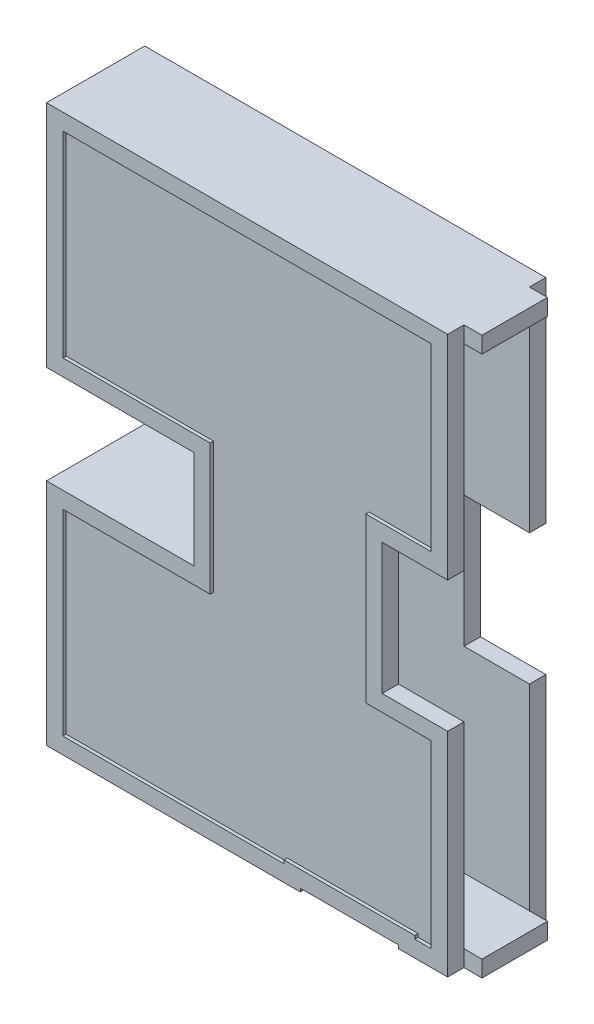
ISO-10303-21;
HEADER;
FILE_DESCRIPTION(('STEP AP214'),'2;1');
FILE_NAME('part.step','',(''),(''),'','','');
FILE_SCHEMA(('AUTOMOTIVE_DESIGN { 1 0 10303 214 1 1 1 1 }'));
ENDSEC;
DATA;
#1=APPLICATION_CONTEXT('core data for automotive mechanical design processes');
#2=APPLICATION_PROTOCOL_DEFINITION('international standard','automotive_design',2000,#1);
#3=PRODUCT_CONTEXT('',#1,'mechanical');
#4=PRODUCT('Part','Part','',(#3));
#5=PRODUCT_RELATED_PRODUCT_CATEGORY('part','',(#4));
#6=PRODUCT_DEFINITION_FORMATION('','',#4);
#7=PRODUCT_DEFINITION_CONTEXT('part definition',#1,'design');
#8=PRODUCT_DEFINITION('design','',#6,#7);
#9=PRODUCT_DEFINITION_SHAPE('','',#8);
#10=(LENGTH_UNIT() NAMED_UNIT(*) SI_UNIT(.MILLI.,.METRE.));
#11=(NAMED_UNIT(*) PLANE_ANGLE_UNIT() SI_UNIT($,.RADIAN.));
#12=(NAMED_UNIT(*) SI_UNIT($,.STERADIAN.) SOLID_ANGLE_UNIT());
#13=UNCERTAINTY_MEASURE_WITH_UNIT(LENGTH_MEASURE(1.E-05),#10,'distance_accuracy_value','');
#14=(GEOMETRIC_REPRESENTATION_CONTEXT(3) GLOBAL_UNCERTAINTY_ASSIGNED_CONTEXT((#13)) GLOBAL_UNIT_ASSIGNED_CONTEXT((#10,
#11,#12)) REPRESENTATION_CONTEXT('',''));
#15=CARTESIAN_POINT('',(0.,0.,0.));
#16=DIRECTION('',(0.,0.,1.));
#17=DIRECTION('',(1.,0.,0.));
#18=AXIS2_PLACEMENT_3D('',#15,#16,#17);
#19=CARTESIAN_POINT('',(122.50000000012,5.0000000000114,15.));
#20=DIRECTION('',(-1.,0.,0.));
#21=DIRECTION('',(0.,0.,1.));
#22=AXIS2_PLACEMENT_3D('',#19,#20,#21);
#23=PLANE('',#22);
#24=DIRECTION('',(0.,0.,-1.));
#25=VECTOR('',#24,1.);
#26=CARTESIAN_POINT('',(122.50000000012,65.0000000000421,15.));
#27=LINE('',#26,#25);
#28=CARTESIAN_POINT('',(122.50000000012,65.0000000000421,-10.));
#29=VERTEX_POINT('',#28);
#30=CARTESIAN_POINT('',(122.50000000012,65.0000000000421,-15.));
#31=VERTEX_POINT('',#30);
#32=EDGE_CURVE('E494',#29,#31,#27,.T.);
#33=ORIENTED_EDGE('',*,*,#32,.F.);
#34=DIRECTION('',(0.,-1.,0.));
#35=VECTOR('',#34,1.);
#36=CARTESIAN_POINT('',(122.50000000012,5.0000000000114,-10.));
#37=LINE('',#36,#35);
#38=CARTESIAN_POINT('',(122.50000000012,4.99999999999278,-10.));
#39=VERTEX_POINT('',#38);
#40=EDGE_CURVE('E562',#29,#39,#37,.T.);
#41=ORIENTED_EDGE('',*,*,#40,.T.);
#42=DIRECTION('',(0.,-1.,0.));
#43=VECTOR('',#42,1.);
#44=CARTESIAN_POINT('',(122.50000000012,170.000000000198,-10.));
#45=LINE('',#44,#43);
#46=CARTESIAN_POINT('',(122.50000000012,3.31712976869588E-13,-10.));
#47=VERTEX_POINT('',#46);
#48=EDGE_CURVE('E466',#39,#47,#45,.T.);
#49=ORIENTED_EDGE('',*,*,#48,.T.);
#50=DIRECTION('',(0.,0.,-1.));
#51=VECTOR('',#50,1.);
#52=CARTESIAN_POINT('',(122.50000000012,3.31712976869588E-13,-15.));
#53=LINE('',#52,#51);
#54=CARTESIAN_POINT('',(122.50000000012,3.31712976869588E-13,-15.));
#55=VERTEX_POINT('',#54);
#56=EDGE_CURVE('E456',#47,#55,#53,.T.);
#57=ORIENTED_EDGE('',*,*,#56,.T.);
#58=DIRECTION('',(0.,1.,0.));
#59=VECTOR('',#58,1.);
#60=CARTESIAN_POINT('',(122.50000000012,5.0000000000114,-15.));
#61=LINE('',#60,#59);
#62=EDGE_CURVE('E708',#55,#31,#61,.T.);
#63=ORIENTED_EDGE('',*,*,#62,.T.);
#64=EDGE_LOOP('',(#33,#41,#49,#57,#63));
#65=FACE_BOUND('',#64,.T.);
#66=ADVANCED_FACE('F33',(#65),#23,.F.);
#67=CARTESIAN_POINT('',(122.50000000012,65.0000000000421,15.));
#68=DIRECTION('',(0.,-1.,0.));
#69=DIRECTION('',(1.,0.,0.));
#70=AXIS2_PLACEMENT_3D('',#67,#68,#69);
#71=PLANE('',#70);
#72=DIRECTION('',(0.,0.,-1.));
#73=VECTOR('',#72,1.);
#74=CARTESIAN_POINT('',(102.50000000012,65.000000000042,15.));
#75=LINE('',#74,#73);
#76=CARTESIAN_POINT('',(102.50000000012,65.000000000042,-10.));
#77=VERTEX_POINT('',#76);
#78=CARTESIAN_POINT('',(102.50000000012,65.000000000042,-15.));
#79=VERTEX_POINT('',#78);
#80=EDGE_CURVE('E490',#77,#79,#75,.T.);
#81=ORIENTED_EDGE('',*,*,#80,.F.);
#82=DIRECTION('',(1.,0.,0.));
#83=VECTOR('',#82,1.);
#84=CARTESIAN_POINT('',(122.50000000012,65.0000000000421,-10.));
#85=LINE('',#84,#83);
#86=EDGE_CURVE('E559',#77,#29,#85,.T.);
#87=ORIENTED_EDGE('',*,*,#86,.T.);
#88=ORIENTED_EDGE('',*,*,#32,.T.);
#89=DIRECTION('',(-1.,0.,0.));
#90=VECTOR('',#89,1.);
#91=CARTESIAN_POINT('',(122.50000000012,65.0000000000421,-15.));
#92=LINE('',#91,#90);
#93=EDGE_CURVE('E705',#31,#79,#92,.T.);
#94=ORIENTED_EDGE('',*,*,#93,.T.);
#95=EDGE_LOOP('',(#81,#87,#88,#94));
#96=FACE_BOUND('',#95,.T.);
#97=ADVANCED_FACE('F922',(#96),#71,.F.);
#98=CARTESIAN_POINT('',(102.50000000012,65.000000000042,15.));
#99=DIRECTION('',(-1.,0.,0.));
#100=DIRECTION('',(0.,0.,1.));
#101=AXIS2_PLACEMENT_3D('',#98,#99,#100);
#102=PLANE('',#101);
#103=DIRECTION('',(0.,0.,-1.));
#104=VECTOR('',#103,1.);
#105=CARTESIAN_POINT('',(102.50000000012,105.000000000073,15.));
#106=LINE('',#105,#104);
#107=CARTESIAN_POINT('',(102.50000000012,105.000000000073,-10.));
#108=VERTEX_POINT('',#107);
#109=CARTESIAN_POINT('',(102.50000000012,105.000000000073,-15.));
#110=VERTEX_POINT('',#109);
#111=EDGE_CURVE('E486',#108,#110,#106,.T.);
#112=ORIENTED_EDGE('',*,*,#111,.F.);
#113=DIRECTION('',(0.,-1.,0.));
#114=VECTOR('',#113,1.);
#115=CARTESIAN_POINT('',(102.50000000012,65.000000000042,-10.));
#116=LINE('',#115,#114);
#117=EDGE_CURVE('E556',#108,#77,#116,.T.);
#118=ORIENTED_EDGE('',*,*,#117,.T.);
#119=ORIENTED_EDGE('',*,*,#80,.T.);
#120=DIRECTION('',(0.,1.,0.));
#121=VECTOR('',#120,1.);
#122=CARTESIAN_POINT('',(102.50000000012,65.000000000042,-15.));
#123=LINE('',#122,#121);
#124=EDGE_CURVE('E702',#79,#110,#123,.T.);
#125=ORIENTED_EDGE('',*,*,#124,.T.);
#126=EDGE_LOOP('',(#112,#118,#119,#125));
#127=FACE_BOUND('',#126,.T.);
#128=ADVANCED_FACE('F918',(#127),#102,.F.);
#129=CARTESIAN_POINT('',(102.50000000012,105.000000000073,15.));
#130=DIRECTION('',(0.,1.,0.));
#131=DIRECTION('',(0.,0.,1.));
#132=AXIS2_PLACEMENT_3D('',#129,#130,#131);
#133=PLANE('',#132);
#134=DIRECTION('',(0.,0.,-1.));
#135=VECTOR('',#134,1.);
#136=CARTESIAN_POINT('',(122.500000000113,105.000000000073,15.));
#137=LINE('',#136,#135);
#138=CARTESIAN_POINT('',(122.500000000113,105.000000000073,-10.));
#139=VERTEX_POINT('',#138);
#140=CARTESIAN_POINT('',(122.500000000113,105.000000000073,-15.));
#141=VERTEX_POINT('',#140);
#142=EDGE_CURVE('E476',#139,#141,#137,.T.);
#143=ORIENTED_EDGE('',*,*,#142,.F.);
#144=DIRECTION('',(-1.,0.,0.));
#145=VECTOR('',#144,1.);
#146=CARTESIAN_POINT('',(102.50000000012,105.000000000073,-10.));
#147=LINE('',#146,#145);
#148=EDGE_CURVE('E553',#139,#108,#147,.T.);
#149=ORIENTED_EDGE('',*,*,#148,.T.);
#150=ORIENTED_EDGE('',*,*,#111,.T.);
#151=DIRECTION('',(1.,0.,0.));
#152=VECTOR('',#151,1.);
#153=CARTESIAN_POINT('',(102.50000000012,105.000000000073,-15.));
#154=LINE('',#153,#152);
#155=EDGE_CURVE('E699',#110,#141,#154,.T.);
#156=ORIENTED_EDGE('',*,*,#155,.T.);
#157=EDGE_LOOP('',(#143,#149,#150,#156));
#158=FACE_BOUND('',#157,.T.);
#159=ADVANCED_FACE('F915',(#158),#133,.F.);
#160=CARTESIAN_POINT('',(122.500000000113,105.000000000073,15.));
#161=DIRECTION('',(-1.,0.,0.));
#162=DIRECTION('',(0.,-1.,0.));
#163=AXIS2_PLACEMENT_3D('',#160,#161,#162);
#164=PLANE('',#163);
#165=DIRECTION('',(0.,1.,0.));
#166=VECTOR('',#165,1.);
#167=CARTESIAN_POINT('',(122.500000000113,105.000000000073,-15.));
#168=LINE('',#167,#166);
#169=CARTESIAN_POINT('',(122.50000000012,170.000000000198,-15.));
#170=VERTEX_POINT('',#169);
#171=EDGE_CURVE('E697',#141,#170,#168,.T.);
#172=ORIENTED_EDGE('',*,*,#171,.T.);
#173=DIRECTION('',(0.,0.,-1.));
#174=VECTOR('',#173,1.);
#175=CARTESIAN_POINT('',(122.50000000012,170.000000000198,-15.));
#176=LINE('',#175,#174);
#177=CARTESIAN_POINT('',(122.50000000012,170.000000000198,-10.));
#178=VERTEX_POINT('',#177);
#179=EDGE_CURVE('E51',#178,#170,#176,.T.);
#180=ORIENTED_EDGE('',*,*,#179,.F.);
#181=CARTESIAN_POINT('',(122.50000000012,165.000000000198,-10.));
#182=VERTEX_POINT('',#181);
#183=EDGE_CURVE('E453',#178,#182,#45,.T.);
#184=ORIENTED_EDGE('',*,*,#183,.T.);
#185=DIRECTION('',(0.,-1.,0.));
#186=VECTOR('',#185,1.);
#187=CARTESIAN_POINT('',(122.500000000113,105.000000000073,-10.));
#188=LINE('',#187,#186);
#189=EDGE_CURVE('E550',#182,#139,#188,.T.);
#190=ORIENTED_EDGE('',*,*,#189,.T.);
#191=ORIENTED_EDGE('',*,*,#142,.T.);
#192=EDGE_LOOP('',(#172,#180,#184,#190,#191));
#193=FACE_BOUND('',#192,.T.);
#194=ADVANCED_FACE('F968',(#193),#164,.F.);
#195=CARTESIAN_POINT('',(0.,0.,-15.));
#196=DIRECTION('',(0.,0.,-1.));
#197=DIRECTION('',(1.,0.,0.));
#198=AXIS2_PLACEMENT_3D('',#195,#196,#197);
#199=PLANE('',#198);
#200=ORIENTED_EDGE('',*,*,#62,.F.);
#201=DIRECTION('',(1.,0.,0.));
#202=VECTOR('',#201,1.);
#203=CARTESIAN_POINT('',(107.500000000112,-7.21644966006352E-12,-15.));
#204=LINE('',#203,#202);
#205=CARTESIAN_POINT('',(107.500000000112,-7.21644966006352E-12,-15.));
#206=VERTEX_POINT('',#205);
#207=EDGE_CURVE('E711',#206,#55,#204,.T.);
#208=ORIENTED_EDGE('',*,*,#207,.F.);
#209=DIRECTION('',(3.06976666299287E-11,-1.,0.));
#210=VECTOR('',#209,1.);
#211=CARTESIAN_POINT('',(107.500000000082,1.00000000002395,-15.));
#212=LINE('',#211,#210);
#213=CARTESIAN_POINT('',(107.500000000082,1.00000000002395,-15.));
#214=VERTEX_POINT('',#213);
#215=EDGE_CURVE('E714',#214,#206,#212,.T.);
#216=ORIENTED_EDGE('',*,*,#215,.F.);
#217=DIRECTION('',(1.,0.,0.));
#218=VECTOR('',#217,1.);
#219=CARTESIAN_POINT('',(77.5000000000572,1.00000000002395,-15.));
#220=LINE('',#219,#218);
#221=CARTESIAN_POINT('',(77.5000000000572,1.00000000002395,-15.));
#222=VERTEX_POINT('',#221);
#223=EDGE_CURVE('E717',#222,#214,#220,.T.);
#224=ORIENTED_EDGE('',*,*,#223,.F.);
#225=DIRECTION('',(0.,1.,0.));
#226=VECTOR('',#225,1.);
#227=CARTESIAN_POINT('',(77.5000000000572,0.,-15.));
#228=LINE('',#227,#226);
#229=CARTESIAN_POINT('',(77.5000000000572,0.,-15.));
#230=VERTEX_POINT('',#229);
#231=EDGE_CURVE('E720',#230,#222,#228,.T.);
#232=ORIENTED_EDGE('',*,*,#231,.F.);
#233=DIRECTION('',(1.,0.,0.));
#234=VECTOR('',#233,1.);
#235=CARTESIAN_POINT('',(0.,0.,-15.));
#236=LINE('',#235,#234);
#237=CARTESIAN_POINT('',(0.,0.,-15.));
#238=VERTEX_POINT('',#237);
#239=EDGE_CURVE('E723',#238,#230,#236,.T.);
#240=ORIENTED_EDGE('',*,*,#239,.F.);
#241=DIRECTION('',(0.,-1.,0.));
#242=VECTOR('',#241,1.);
#243=CARTESIAN_POINT('',(0.,70.000000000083,-15.));
#244=LINE('',#243,#242);
#245=CARTESIAN_POINT('',(0.,70.000000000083,-15.));
#246=VERTEX_POINT('',#245);
#247=EDGE_CURVE('E650',#246,#238,#244,.T.);
#248=ORIENTED_EDGE('',*,*,#247,.F.);
#249=DIRECTION('',(-1.,0.,0.));
#250=VECTOR('',#249,1.);
#251=CARTESIAN_POINT('',(45.,70.000000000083,-15.));
#252=LINE('',#251,#250);
#253=CARTESIAN_POINT('',(45.,70.000000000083,-15.));
#254=VERTEX_POINT('',#253);
#255=EDGE_CURVE('E683',#254,#246,#252,.T.);
#256=ORIENTED_EDGE('',*,*,#255,.F.);
#257=DIRECTION('',(0.,-1.,0.));
#258=VECTOR('',#257,1.);
#259=CARTESIAN_POINT('',(45.,100.000000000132,-15.));
#260=LINE('',#259,#258);
#261=CARTESIAN_POINT('',(45.,100.000000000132,-15.));
#262=VERTEX_POINT('',#261);
#263=EDGE_CURVE('E686',#262,#254,#260,.T.);
#264=ORIENTED_EDGE('',*,*,#263,.F.);
#265=DIRECTION('',(1.,0.,0.));
#266=VECTOR('',#265,1.);
#267=CARTESIAN_POINT('',(0.,100.000000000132,-15.));
#268=LINE('',#267,#266);
#269=CARTESIAN_POINT('',(0.,100.000000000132,-15.));
#270=VERTEX_POINT('',#269);
#271=EDGE_CURVE('E689',#270,#262,#268,.T.);
#272=ORIENTED_EDGE('',*,*,#271,.F.);
#273=DIRECTION('',(0.,-1.,0.));
#274=VECTOR('',#273,1.);
#275=CARTESIAN_POINT('',(0.,170.000000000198,-15.));
#276=LINE('',#275,#274);
#277=CARTESIAN_POINT('',(0.,170.000000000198,-15.));
#278=VERTEX_POINT('',#277);
#279=EDGE_CURVE('E692',#278,#270,#276,.T.);
#280=ORIENTED_EDGE('',*,*,#279,.F.);
#281=DIRECTION('',(-1.,0.,0.));
#282=VECTOR('',#281,1.);
#283=CARTESIAN_POINT('',(128.00000000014,170.000000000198,-15.));
#284=LINE('',#283,#282);
#285=EDGE_CURVE('E695',#170,#278,#284,.T.);
#286=ORIENTED_EDGE('',*,*,#285,.F.);
#287=ORIENTED_EDGE('',*,*,#171,.F.);
#288=ORIENTED_EDGE('',*,*,#155,.F.);
#289=ORIENTED_EDGE('',*,*,#124,.F.);
#290=ORIENTED_EDGE('',*,*,#93,.F.);
#291=EDGE_LOOP('',(#200,#208,#216,#224,#232,#240,#248,#256,#264,#272,#280,#286,#287,#288,#289,#290));
#292=FACE_BOUND('',#291,.T.);
#293=DIRECTION('',(1.,0.,0.));
#294=VECTOR('',#293,1.);
#295=CARTESIAN_POINT('',(64.00000000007,105.000000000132,-15.));
#296=LINE('',#295,#294);
#297=CARTESIAN_POINT('',(5.,105.000000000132,-15.));
#298=VERTEX_POINT('',#297);
#299=CARTESIAN_POINT('',(50.,105.000000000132,-15.));
#300=VERTEX_POINT('',#299);
#301=EDGE_CURVE('E603',#298,#300,#296,.T.);
#302=ORIENTED_EDGE('',*,*,#301,.T.);
#303=DIRECTION('',(0.,-1.,0.));
#304=VECTOR('',#303,1.);
#305=CARTESIAN_POINT('',(50.,-80.6612691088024,-15.));
#306=LINE('',#305,#304);
#307=CARTESIAN_POINT('',(50.,65.000000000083,-15.));
#308=VERTEX_POINT('',#307);
#309=EDGE_CURVE('E565',#300,#308,#306,.T.);
#310=ORIENTED_EDGE('',*,*,#309,.T.);
#311=DIRECTION('',(-1.,0.,0.));
#312=VECTOR('',#311,1.);
#313=CARTESIAN_POINT('',(64.0000000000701,65.000000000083,-15.));
#314=LINE('',#313,#312);
#315=CARTESIAN_POINT('',(5.,65.000000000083,-15.));
#316=VERTEX_POINT('',#315);
#317=EDGE_CURVE('E570',#308,#316,#314,.T.);
#318=ORIENTED_EDGE('',*,*,#317,.T.);
#319=DIRECTION('',(0.,-1.,0.));
#320=VECTOR('',#319,1.);
#321=CARTESIAN_POINT('',(5.,-80.6612691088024,-15.));
#322=LINE('',#321,#320);
#323=CARTESIAN_POINT('',(5.,5.,-15.));
#324=VERTEX_POINT('',#323);
#325=EDGE_CURVE('E642',#316,#324,#322,.T.);
#326=ORIENTED_EDGE('',*,*,#325,.T.);
#327=DIRECTION('',(1.,0.,0.));
#328=VECTOR('',#327,1.);
#329=CARTESIAN_POINT('',(64.0000000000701,4.99999999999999,-15.));
#330=LINE('',#329,#328);
#331=CARTESIAN_POINT('',(72.5000000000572,4.99999999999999,-15.));
#332=VERTEX_POINT('',#331);
#333=EDGE_CURVE('E639',#324,#332,#330,.T.);
#334=ORIENTED_EDGE('',*,*,#333,.T.);
#335=DIRECTION('',(0.,1.,0.));
#336=VECTOR('',#335,1.);
#337=CARTESIAN_POINT('',(72.5000000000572,-80.6612691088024,-15.));
#338=LINE('',#337,#336);
#339=CARTESIAN_POINT('',(72.5000000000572,6.00000000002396,-15.));
#340=VERTEX_POINT('',#339);
#341=EDGE_CURVE('E636',#332,#340,#338,.T.);
#342=ORIENTED_EDGE('',*,*,#341,.T.);
#343=DIRECTION('',(1.,0.,0.));
#344=VECTOR('',#343,1.);
#345=CARTESIAN_POINT('',(64.0000000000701,6.00000000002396,-15.));
#346=LINE('',#345,#344);
#347=CARTESIAN_POINT('',(112.499999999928,6.00000000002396,-15.));
#348=VERTEX_POINT('',#347);
#349=EDGE_CURVE('E633',#340,#348,#346,.T.);
#350=ORIENTED_EDGE('',*,*,#349,.T.);
#351=DIRECTION('',(3.06976666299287E-11,-1.,0.));
#352=VECTOR('',#351,1.);
#353=CARTESIAN_POINT('',(112.500000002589,-80.6612691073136,-15.));
#354=LINE('',#353,#352);
#355=CARTESIAN_POINT('',(112.499999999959,4.99999999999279,-15.));
#356=VERTEX_POINT('',#355);
#357=EDGE_CURVE('E630',#348,#356,#354,.T.);
#358=ORIENTED_EDGE('',*,*,#357,.T.);
#359=DIRECTION('',(1.,0.,0.));
#360=VECTOR('',#359,1.);
#361=CARTESIAN_POINT('',(64.0000000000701,4.99999999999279,-15.));
#362=LINE('',#361,#360);
#363=CARTESIAN_POINT('',(117.50000000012,4.99999999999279,-15.));
#364=VERTEX_POINT('',#363);
#365=EDGE_CURVE('E627',#356,#364,#362,.T.);
#366=ORIENTED_EDGE('',*,*,#365,.T.);
#367=DIRECTION('',(0.,1.,0.));
#368=VECTOR('',#367,1.);
#369=CARTESIAN_POINT('',(117.50000000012,-80.6612691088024,-15.));
#370=LINE('',#369,#368);
#371=CARTESIAN_POINT('',(117.50000000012,60.0000000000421,-15.));
#372=VERTEX_POINT('',#371);
#373=EDGE_CURVE('E624',#364,#372,#370,.T.);
#374=ORIENTED_EDGE('',*,*,#373,.T.);
#375=DIRECTION('',(-1.,0.,0.));
#376=VECTOR('',#375,1.);
#377=CARTESIAN_POINT('',(64.0000000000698,60.000000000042,-15.));
#378=LINE('',#377,#376);
#379=CARTESIAN_POINT('',(97.5000000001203,60.000000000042,-15.));
#380=VERTEX_POINT('',#379);
#381=EDGE_CURVE('E621',#372,#380,#378,.T.);
#382=ORIENTED_EDGE('',*,*,#381,.T.);
#383=DIRECTION('',(0.,1.,0.));
#384=VECTOR('',#383,1.);
#385=CARTESIAN_POINT('',(97.5000000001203,-80.6612691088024,-15.));
#386=LINE('',#385,#384);
#387=CARTESIAN_POINT('',(97.5000000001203,110.000000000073,-15.));
#388=VERTEX_POINT('',#387);
#389=EDGE_CURVE('E618',#380,#388,#386,.T.);
#390=ORIENTED_EDGE('',*,*,#389,.T.);
#391=DIRECTION('',(1.,0.,0.));
#392=VECTOR('',#391,1.);
#393=CARTESIAN_POINT('',(64.0000000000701,110.000000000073,-15.));
#394=LINE('',#393,#392);
#395=CARTESIAN_POINT('',(117.500000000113,110.000000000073,-15.));
#396=VERTEX_POINT('',#395);
#397=EDGE_CURVE('E615',#388,#396,#394,.T.);
#398=ORIENTED_EDGE('',*,*,#397,.T.);
#399=DIRECTION('',(0.,1.,0.));
#400=VECTOR('',#399,1.);
#401=CARTESIAN_POINT('',(117.500000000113,-80.6612691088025,-15.));
#402=LINE('',#401,#400);
#403=CARTESIAN_POINT('',(117.500000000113,165.000000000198,-15.));
#404=VERTEX_POINT('',#403);
#405=EDGE_CURVE('E612',#396,#404,#402,.T.);
#406=ORIENTED_EDGE('',*,*,#405,.T.);
#407=DIRECTION('',(-1.,0.,0.));
#408=VECTOR('',#407,1.);
#409=CARTESIAN_POINT('',(64.0000000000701,165.000000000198,-15.));
#410=LINE('',#409,#408);
#411=CARTESIAN_POINT('',(5.,165.000000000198,-15.));
#412=VERTEX_POINT('',#411);
#413=EDGE_CURVE('E609',#404,#412,#410,.T.);
#414=ORIENTED_EDGE('',*,*,#413,.T.);
#415=DIRECTION('',(0.,-1.,0.));
#416=VECTOR('',#415,1.);
#417=CARTESIAN_POINT('',(5.,-80.6612691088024,-15.));
#418=LINE('',#417,#416);
#419=EDGE_CURVE('E606',#412,#298,#418,.T.);
#420=ORIENTED_EDGE('',*,*,#419,.T.);
#421=EDGE_LOOP('',(#302,#310,#318,#326,#334,#342,#350,#358,#366,#374,#382,#390,#398,#406,#414,#420));
#422=FACE_BOUND('',#421,.T.);
#423=ADVANCED_FACE('F903',(#292,#422),#199,.T.);
#424=CARTESIAN_POINT('',(0.,70.000000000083,15.));
#425=DIRECTION('',(1.,0.,0.));
#426=DIRECTION('',(0.,0.,-1.));
#427=AXIS2_PLACEMENT_3D('',#424,#425,#426);
#428=PLANE('',#427);
#429=DIRECTION('',(0.,0.,-1.));
#430=VECTOR('',#429,1.);
#431=CARTESIAN_POINT('',(0.,70.000000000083,15.));
#432=LINE('',#431,#430);
#433=CARTESIAN_POINT('',(0.,70.000000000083,15.));
#434=VERTEX_POINT('',#433);
#435=EDGE_CURVE('E887',#434,#246,#432,.T.);
#436=ORIENTED_EDGE('',*,*,#435,.T.);
#437=ORIENTED_EDGE('',*,*,#247,.T.);
#438=DIRECTION('',(0.,0.,-1.));
#439=VECTOR('',#438,1.);
#440=CARTESIAN_POINT('',(0.,0.,15.));
#441=LINE('',#440,#439);
#442=CARTESIAN_POINT('',(0.,0.,15.));
#443=VERTEX_POINT('',#442);
#444=EDGE_CURVE('E12',#443,#238,#441,.T.);
#445=ORIENTED_EDGE('',*,*,#444,.F.);
#446=DIRECTION('',(0.,-1.,0.));
#447=VECTOR('',#446,1.);
#448=CARTESIAN_POINT('',(0.,70.000000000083,15.));
#449=LINE('',#448,#447);
#450=EDGE_CURVE('E824',#434,#443,#449,.T.);
#451=ORIENTED_EDGE('',*,*,#450,.F.);
#452=EDGE_LOOP('',(#436,#437,#445,#451));
#453=FACE_BOUND('',#452,.T.);
#454=ADVANCED_FACE('F35',(#453),#428,.F.);
#455=CARTESIAN_POINT('',(0.,0.,15.));
#456=DIRECTION('',(0.,1.,0.));
#457=DIRECTION('',(-1.,0.,0.));
#458=AXIS2_PLACEMENT_3D('',#455,#456,#457);
#459=PLANE('',#458);
#460=ORIENTED_EDGE('',*,*,#444,.T.);
#461=ORIENTED_EDGE('',*,*,#239,.T.);
#462=DIRECTION('',(0.,0.,-1.));
#463=VECTOR('',#462,1.);
#464=CARTESIAN_POINT('',(77.5000000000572,0.,15.));
#465=LINE('',#464,#463);
#466=CARTESIAN_POINT('',(77.5000000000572,0.,15.));
#467=VERTEX_POINT('',#466);
#468=EDGE_CURVE('E43',#467,#230,#465,.T.);
#469=ORIENTED_EDGE('',*,*,#468,.F.);
#470=DIRECTION('',(1.,0.,0.));
#471=VECTOR('',#470,1.);
#472=CARTESIAN_POINT('',(0.,0.,15.));
#473=LINE('',#472,#471);
#474=EDGE_CURVE('E857',#443,#467,#473,.T.);
#475=ORIENTED_EDGE('',*,*,#474,.F.);
#476=EDGE_LOOP('',(#460,#461,#469,#475));
#477=FACE_BOUND('',#476,.T.);
#478=ADVANCED_FACE('F948',(#477),#459,.F.);
#479=CARTESIAN_POINT('',(77.5000000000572,0.,15.));
#480=DIRECTION('',(-1.,0.,0.));
#481=DIRECTION('',(0.,0.,1.));
#482=AXIS2_PLACEMENT_3D('',#479,#480,#481);
#483=PLANE('',#482);
#484=ORIENTED_EDGE('',*,*,#468,.T.);
#485=ORIENTED_EDGE('',*,*,#231,.T.);
#486=DIRECTION('',(0.,0.,-1.));
#487=VECTOR('',#486,1.);
#488=CARTESIAN_POINT('',(77.5000000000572,1.00000000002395,15.));
#489=LINE('',#488,#487);
#490=CARTESIAN_POINT('',(77.5000000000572,1.00000000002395,15.));
#491=VERTEX_POINT('',#490);
#492=EDGE_CURVE('E508',#491,#222,#489,.T.);
#493=ORIENTED_EDGE('',*,*,#492,.F.);
#494=DIRECTION('',(0.,1.,0.));
#495=VECTOR('',#494,1.);
#496=CARTESIAN_POINT('',(77.5000000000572,0.,15.));
#497=LINE('',#496,#495);
#498=EDGE_CURVE('E859',#467,#491,#497,.T.);
#499=ORIENTED_EDGE('',*,*,#498,.F.);
#500=EDGE_LOOP('',(#484,#485,#493,#499));
#501=FACE_BOUND('',#500,.T.);
#502=ADVANCED_FACE('F944',(#501),#483,.F.);
#503=CARTESIAN_POINT('',(77.5000000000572,1.00000000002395,15.));
#504=DIRECTION('',(0.,1.,0.));
#505=DIRECTION('',(0.,0.,1.));
#506=AXIS2_PLACEMENT_3D('',#503,#504,#505);
#507=PLANE('',#506);
#508=ORIENTED_EDGE('',*,*,#492,.T.);
#509=ORIENTED_EDGE('',*,*,#223,.T.);
#510=DIRECTION('',(0.,0.,-1.));
#511=VECTOR('',#510,1.);
#512=CARTESIAN_POINT('',(107.500000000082,1.00000000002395,15.));
#513=LINE('',#512,#511);
#514=CARTESIAN_POINT('',(107.500000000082,1.00000000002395,15.));
#515=VERTEX_POINT('',#514);
#516=EDGE_CURVE('E506',#515,#214,#513,.T.);
#517=ORIENTED_EDGE('',*,*,#516,.F.);
#518=DIRECTION('',(1.,0.,0.));
#519=VECTOR('',#518,1.);
#520=CARTESIAN_POINT('',(77.5000000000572,1.00000000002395,15.));
#521=LINE('',#520,#519);
#522=EDGE_CURVE('E861',#491,#515,#521,.T.);
#523=ORIENTED_EDGE('',*,*,#522,.F.);
#524=EDGE_LOOP('',(#508,#509,#517,#523));
#525=FACE_BOUND('',#524,.T.);
#526=ADVANCED_FACE('F939',(#525),#507,.F.);
#527=CARTESIAN_POINT('',(107.500000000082,1.00000000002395,15.));
#528=DIRECTION('',(1.,3.06976666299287E-11,0.));
#529=DIRECTION('',(-3.06976666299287E-11,1.,0.));
#530=AXIS2_PLACEMENT_3D('',#527,#528,#529);
#531=PLANE('',#530);
#532=ORIENTED_EDGE('',*,*,#516,.T.);
#533=ORIENTED_EDGE('',*,*,#215,.T.);
#534=DIRECTION('',(0.,0.,-1.));
#535=VECTOR('',#534,1.);
#536=CARTESIAN_POINT('',(107.500000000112,-7.21644966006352E-12,15.));
#537=LINE('',#536,#535);
#538=CARTESIAN_POINT('',(107.500000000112,-7.21644966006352E-12,15.));
#539=VERTEX_POINT('',#538);
#540=EDGE_CURVE('E504',#539,#206,#537,.T.);
#541=ORIENTED_EDGE('',*,*,#540,.F.);
#542=DIRECTION('',(3.06976666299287E-11,-1.,0.));
#543=VECTOR('',#542,1.);
#544=CARTESIAN_POINT('',(107.500000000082,1.00000000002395,15.));
#545=LINE('',#544,#543);
#546=EDGE_CURVE('E863',#515,#539,#545,.T.);
#547=ORIENTED_EDGE('',*,*,#546,.F.);
#548=EDGE_LOOP('',(#532,#533,#541,#547));
#549=FACE_BOUND('',#548,.T.);
#550=ADVANCED_FACE('F933',(#549),#531,.F.);
#551=CARTESIAN_POINT('',(107.500000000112,-7.21644966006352E-12,15.));
#552=DIRECTION('',(0.,1.,0.));
#553=DIRECTION('',(0.,0.,1.));
#554=AXIS2_PLACEMENT_3D('',#551,#552,#553);
#555=PLANE('',#554);
#556=ORIENTED_EDGE('',*,*,#207,.T.);
#557=ORIENTED_EDGE('',*,*,#56,.F.);
#558=DIRECTION('',(-1.,0.,0.));
#559=VECTOR('',#558,1.);
#560=CARTESIAN_POINT('',(128.00000000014,3.46606212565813E-13,-10.));
#561=LINE('',#560,#559);
#562=CARTESIAN_POINT('',(128.00000000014,3.46606212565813E-13,-10.));
#563=VERTEX_POINT('',#562);
#564=EDGE_CURVE('E1095',#563,#47,#561,.T.);
#565=ORIENTED_EDGE('',*,*,#564,.F.);
#566=DIRECTION('',(0.,0.,-1.));
#567=VECTOR('',#566,1.);
#568=CARTESIAN_POINT('',(128.00000000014,-7.21644966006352E-12,15.));
#569=LINE('',#568,#567);
#570=CARTESIAN_POINT('',(128.00000000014,3.46606212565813E-13,10.));
#571=VERTEX_POINT('',#570);
#572=EDGE_CURVE('E501',#571,#563,#569,.T.);
#573=ORIENTED_EDGE('',*,*,#572,.F.);
#574=DIRECTION('',(1.,0.,0.));
#575=VECTOR('',#574,1.);
#576=CARTESIAN_POINT('',(122.50000000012,3.31712976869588E-13,10.));
#577=LINE('',#576,#575);
#578=CARTESIAN_POINT('',(122.50000000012,3.31712976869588E-13,10.));
#579=VERTEX_POINT('',#578);
#580=EDGE_CURVE('E999',#579,#571,#577,.T.);
#581=ORIENTED_EDGE('',*,*,#580,.F.);
#582=DIRECTION('',(0.,0.,-1.));
#583=VECTOR('',#582,1.);
#584=CARTESIAN_POINT('',(122.50000000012,3.31712976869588E-13,15.));
#585=LINE('',#584,#583);
#586=CARTESIAN_POINT('',(122.50000000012,3.31712976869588E-13,15.));
#587=VERTEX_POINT('',#586);
#588=EDGE_CURVE('E994',#587,#579,#585,.T.);
#589=ORIENTED_EDGE('',*,*,#588,.F.);
#590=DIRECTION('',(1.,0.,0.));
#591=VECTOR('',#590,1.);
#592=CARTESIAN_POINT('',(107.500000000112,-7.21644966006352E-12,15.));
#593=LINE('',#592,#591);
#594=EDGE_CURVE('E865',#539,#587,#593,.T.);
#595=ORIENTED_EDGE('',*,*,#594,.F.);
#596=ORIENTED_EDGE('',*,*,#540,.T.);
#597=EDGE_LOOP('',(#556,#557,#565,#573,#581,#589,#595,#596));
#598=FACE_BOUND('',#597,.T.);
#599=ADVANCED_FACE('F997',(#598),#555,.F.);
#600=CARTESIAN_POINT('',(128.00000000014,-7.21644966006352E-12,15.));
#601=DIRECTION('',(-1.,0.,0.));
#602=DIRECTION('',(0.,0.,1.));
#603=AXIS2_PLACEMENT_3D('',#600,#601,#602);
#604=PLANE('',#603);
#605=ORIENTED_EDGE('',*,*,#572,.T.);
#606=DIRECTION('',(0.,-1.,0.));
#607=VECTOR('',#606,1.);
#608=CARTESIAN_POINT('',(128.00000000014,170.000000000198,-10.));
#609=LINE('',#608,#607);
#610=CARTESIAN_POINT('',(128.00000000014,5.00000000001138,-10.));
#611=VERTEX_POINT('',#610);
#612=EDGE_CURVE('E467',#611,#563,#609,.T.);
#613=ORIENTED_EDGE('',*,*,#612,.F.);
#614=DIRECTION('',(0.,0.,-1.));
#615=VECTOR('',#614,1.);
#616=CARTESIAN_POINT('',(128.00000000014,5.00000000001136,15.));
#617=LINE('',#616,#615);
#618=CARTESIAN_POINT('',(128.00000000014,5.00000000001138,10.));
#619=VERTEX_POINT('',#618);
#620=EDGE_CURVE('E498',#619,#611,#617,.T.);
#621=ORIENTED_EDGE('',*,*,#620,.F.);
#622=DIRECTION('',(0.,-1.,0.));
#623=VECTOR('',#622,1.);
#624=CARTESIAN_POINT('',(128.00000000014,170.000000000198,10.));
#625=LINE('',#624,#623);
#626=EDGE_CURVE('E1013',#619,#571,#625,.T.);
#627=ORIENTED_EDGE('',*,*,#626,.T.);
#628=EDGE_LOOP('',(#605,#613,#621,#627));
#629=FACE_BOUND('',#628,.T.);
#630=ADVANCED_FACE('F988',(#629),#604,.F.);
#631=CARTESIAN_POINT('',(128.00000000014,5.00000000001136,15.));
#632=DIRECTION('',(0.,-1.,0.));
#633=DIRECTION('',(1.,0.,0.));
#634=AXIS2_PLACEMENT_3D('',#631,#632,#633);
#635=PLANE('',#634);
#636=ORIENTED_EDGE('',*,*,#620,.T.);
#637=DIRECTION('',(-1.,0.,0.));
#638=VECTOR('',#637,1.);
#639=CARTESIAN_POINT('',(128.00000000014,5.00000000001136,-10.));
#640=LINE('',#639,#638);
#641=EDGE_CURVE('E1000',#611,#39,#640,.T.);
#642=ORIENTED_EDGE('',*,*,#641,.T.);
#643=DIRECTION('',(1.,0.,0.));
#644=VECTOR('',#643,1.);
#645=CARTESIAN_POINT('',(-116.245154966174,4.99999999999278,-10.));
#646=LINE('',#645,#644);
#647=CARTESIAN_POINT('',(4.99999999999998,4.99999999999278,-10.));
#648=VERTEX_POINT('',#647);
#649=EDGE_CURVE('E523',#648,#39,#646,.T.);
#650=ORIENTED_EDGE('',*,*,#649,.F.);
#651=DIRECTION('',(0.,0.,1.));
#652=VECTOR('',#651,1.);
#653=CARTESIAN_POINT('',(5.,4.99999999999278,10.));
#654=LINE('',#653,#652);
#655=CARTESIAN_POINT('',(5.,4.99999999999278,10.));
#656=VERTEX_POINT('',#655);
#657=EDGE_CURVE('E1031',#648,#656,#654,.T.);
#658=ORIENTED_EDGE('',*,*,#657,.T.);
#659=DIRECTION('',(1.,0.,0.));
#660=VECTOR('',#659,1.);
#661=CARTESIAN_POINT('',(-116.245154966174,4.99999999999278,10.));
#662=LINE('',#661,#660);
#663=CARTESIAN_POINT('',(122.50000000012,4.99999999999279,10.));
#664=VERTEX_POINT('',#663);
#665=EDGE_CURVE('E526',#656,#664,#662,.T.);
#666=ORIENTED_EDGE('',*,*,#665,.T.);
#667=DIRECTION('',(1.,0.,0.));
#668=VECTOR('',#667,1.);
#669=CARTESIAN_POINT('',(128.00000000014,5.00000000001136,10.));
#670=LINE('',#669,#668);
#671=EDGE_CURVE('E1019',#664,#619,#670,.T.);
#672=ORIENTED_EDGE('',*,*,#671,.T.);
#673=EDGE_LOOP('',(#636,#642,#650,#658,#666,#672));
#674=FACE_BOUND('',#673,.T.);
#675=ADVANCED_FACE('F980',(#674),#635,.F.);
#676=DIRECTION('',(0.,1.,0.));
#677=VECTOR('',#676,1.);
#678=CARTESIAN_POINT('',(122.50000000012,5.0000000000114,15.));
#679=LINE('',#678,#677);
#680=CARTESIAN_POINT('',(122.50000000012,65.0000000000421,15.));
#681=VERTEX_POINT('',#680);
#682=EDGE_CURVE('E868',#587,#681,#679,.T.);
#683=ORIENTED_EDGE('',*,*,#682,.F.);
#684=ORIENTED_EDGE('',*,*,#588,.T.);
#685=DIRECTION('',(0.,-1.,0.));
#686=VECTOR('',#685,1.);
#687=CARTESIAN_POINT('',(122.50000000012,170.000000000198,10.));
#688=LINE('',#687,#686);
#689=EDGE_CURVE('E1016',#664,#579,#688,.T.);
#690=ORIENTED_EDGE('',*,*,#689,.F.);
#691=DIRECTION('',(0.,1.,0.));
#692=VECTOR('',#691,1.);
#693=CARTESIAN_POINT('',(122.50000000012,5.0000000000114,10.));
#694=LINE('',#693,#692);
#695=CARTESIAN_POINT('',(122.50000000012,65.0000000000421,10.));
#696=VERTEX_POINT('',#695);
#697=EDGE_CURVE('E547',#664,#696,#694,.T.);
#698=ORIENTED_EDGE('',*,*,#697,.T.);
#699=EDGE_CURVE('E495',#681,#696,#27,.T.);
#700=ORIENTED_EDGE('',*,*,#699,.F.);
#701=EDGE_LOOP('',(#683,#684,#690,#698,#700));
#702=FACE_BOUND('',#701,.T.);
#703=ADVANCED_FACE('F972',(#702),#23,.F.);
#704=ORIENTED_EDGE('',*,*,#699,.T.);
#705=DIRECTION('',(-1.,0.,0.));
#706=VECTOR('',#705,1.);
#707=CARTESIAN_POINT('',(122.50000000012,65.0000000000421,10.));
#708=LINE('',#707,#706);
#709=CARTESIAN_POINT('',(102.50000000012,65.000000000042,10.));
#710=VERTEX_POINT('',#709);
#711=EDGE_CURVE('E544',#696,#710,#708,.T.);
#712=ORIENTED_EDGE('',*,*,#711,.T.);
#713=CARTESIAN_POINT('',(102.50000000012,65.000000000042,15.));
#714=VERTEX_POINT('',#713);
#715=EDGE_CURVE('E491',#714,#710,#75,.T.);
#716=ORIENTED_EDGE('',*,*,#715,.F.);
#717=DIRECTION('',(-1.,0.,0.));
#718=VECTOR('',#717,1.);
#719=CARTESIAN_POINT('',(122.50000000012,65.0000000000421,15.));
#720=LINE('',#719,#718);
#721=EDGE_CURVE('E870',#681,#714,#720,.T.);
#722=ORIENTED_EDGE('',*,*,#721,.F.);
#723=EDGE_LOOP('',(#704,#712,#716,#722));
#724=FACE_BOUND('',#723,.T.);
#725=ADVANCED_FACE('F977',(#724),#71,.F.);
#726=ORIENTED_EDGE('',*,*,#715,.T.);
#727=DIRECTION('',(0.,1.,0.));
#728=VECTOR('',#727,1.);
#729=CARTESIAN_POINT('',(102.50000000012,65.000000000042,10.));
#730=LINE('',#729,#728);
#731=CARTESIAN_POINT('',(102.50000000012,105.000000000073,10.));
#732=VERTEX_POINT('',#731);
#733=EDGE_CURVE('E541',#710,#732,#730,.T.);
#734=ORIENTED_EDGE('',*,*,#733,.T.);
#735=CARTESIAN_POINT('',(102.50000000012,105.000000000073,15.));
#736=VERTEX_POINT('',#735);
#737=EDGE_CURVE('E487',#736,#732,#106,.T.);
#738=ORIENTED_EDGE('',*,*,#737,.F.);
#739=DIRECTION('',(0.,1.,0.));
#740=VECTOR('',#739,1.);
#741=CARTESIAN_POINT('',(102.50000000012,65.000000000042,15.));
#742=LINE('',#741,#740);
#743=EDGE_CURVE('E872',#714,#736,#742,.T.);
#744=ORIENTED_EDGE('',*,*,#743,.F.);
#745=EDGE_LOOP('',(#726,#734,#738,#744));
#746=FACE_BOUND('',#745,.T.);
#747=ADVANCED_FACE('F986',(#746),#102,.F.);
#748=ORIENTED_EDGE('',*,*,#737,.T.);
#749=DIRECTION('',(1.,0.,0.));
#750=VECTOR('',#749,1.);
#751=CARTESIAN_POINT('',(102.50000000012,105.000000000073,10.));
#752=LINE('',#751,#750);
#753=CARTESIAN_POINT('',(122.500000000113,105.000000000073,10.));
#754=VERTEX_POINT('',#753);
#755=EDGE_CURVE('E538',#732,#754,#752,.T.);
#756=ORIENTED_EDGE('',*,*,#755,.T.);
#757=CARTESIAN_POINT('',(122.500000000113,105.000000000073,15.));
#758=VERTEX_POINT('',#757);
#759=EDGE_CURVE('E483',#758,#754,#137,.T.);
#760=ORIENTED_EDGE('',*,*,#759,.F.);
#761=DIRECTION('',(1.,0.,0.));
#762=VECTOR('',#761,1.);
#763=CARTESIAN_POINT('',(102.50000000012,105.000000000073,15.));
#764=LINE('',#763,#762);
#765=EDGE_CURVE('E874',#736,#758,#764,.T.);
#766=ORIENTED_EDGE('',*,*,#765,.F.);
#767=EDGE_LOOP('',(#748,#756,#760,#766));
#768=FACE_BOUND('',#767,.T.);
#769=ADVANCED_FACE('F1084',(#768),#133,.F.);
#770=ORIENTED_EDGE('',*,*,#759,.T.);
#771=DIRECTION('',(0.,1.,0.));
#772=VECTOR('',#771,1.);
#773=CARTESIAN_POINT('',(122.500000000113,105.000000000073,10.));
#774=LINE('',#773,#772);
#775=CARTESIAN_POINT('',(122.50000000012,165.000000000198,10.));
#776=VERTEX_POINT('',#775);
#777=EDGE_CURVE('E515',#754,#776,#774,.T.);
#778=ORIENTED_EDGE('',*,*,#777,.T.);
#779=CARTESIAN_POINT('',(122.50000000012,170.000000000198,10.));
#780=VERTEX_POINT('',#779);
#781=EDGE_CURVE('E1014',#780,#776,#688,.T.);
#782=ORIENTED_EDGE('',*,*,#781,.F.);
#783=DIRECTION('',(0.,0.,-1.));
#784=VECTOR('',#783,1.);
#785=CARTESIAN_POINT('',(122.50000000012,170.000000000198,15.));
#786=LINE('',#785,#784);
#787=CARTESIAN_POINT('',(122.50000000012,170.000000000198,15.));
#788=VERTEX_POINT('',#787);
#789=EDGE_CURVE('E1002',#788,#780,#786,.T.);
#790=ORIENTED_EDGE('',*,*,#789,.F.);
#791=DIRECTION('',(0.,1.,0.));
#792=VECTOR('',#791,1.);
#793=CARTESIAN_POINT('',(122.500000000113,105.000000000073,15.));
#794=LINE('',#793,#792);
#795=EDGE_CURVE('E59',#758,#788,#794,.T.);
#796=ORIENTED_EDGE('',*,*,#795,.F.);
#797=EDGE_LOOP('',(#770,#778,#782,#790,#796));
#798=FACE_BOUND('',#797,.T.);
#799=ADVANCED_FACE('F1080',(#798),#164,.F.);
#800=CARTESIAN_POINT('',(122.500000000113,165.000000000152,15.));
#801=DIRECTION('',(0.,1.,0.));
#802=DIRECTION('',(0.,0.,1.));
#803=AXIS2_PLACEMENT_3D('',#800,#801,#802);
#804=PLANE('',#803);
#805=DIRECTION('',(1.,0.,0.));
#806=VECTOR('',#805,1.);
#807=CARTESIAN_POINT('',(-116.245154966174,165.000000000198,-10.));
#808=LINE('',#807,#806);
#809=CARTESIAN_POINT('',(5.,165.000000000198,-9.99999999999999));
#810=VERTEX_POINT('',#809);
#811=EDGE_CURVE('E532',#810,#182,#808,.T.);
#812=ORIENTED_EDGE('',*,*,#811,.T.);
#813=DIRECTION('',(1.,0.,0.));
#814=VECTOR('',#813,1.);
#815=CARTESIAN_POINT('',(122.500000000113,165.000000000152,-10.));
#816=LINE('',#815,#814);
#817=CARTESIAN_POINT('',(128.00000000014,165.000000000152,-10.));
#818=VERTEX_POINT('',#817);
#819=EDGE_CURVE('E1005',#182,#818,#816,.T.);
#820=ORIENTED_EDGE('',*,*,#819,.T.);
#821=DIRECTION('',(0.,0.,-1.));
#822=VECTOR('',#821,1.);
#823=CARTESIAN_POINT('',(128.00000000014,165.000000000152,15.));
#824=LINE('',#823,#822);
#825=CARTESIAN_POINT('',(128.00000000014,165.000000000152,10.));
#826=VERTEX_POINT('',#825);
#827=EDGE_CURVE('E465',#826,#818,#824,.T.);
#828=ORIENTED_EDGE('',*,*,#827,.F.);
#829=DIRECTION('',(-1.,0.,0.));
#830=VECTOR('',#829,1.);
#831=CARTESIAN_POINT('',(122.500000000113,165.000000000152,10.));
#832=LINE('',#831,#830);
#833=EDGE_CURVE('E1012',#826,#776,#832,.T.);
#834=ORIENTED_EDGE('',*,*,#833,.T.);
#835=DIRECTION('',(1.,0.,0.));
#836=VECTOR('',#835,1.);
#837=CARTESIAN_POINT('',(-116.245154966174,165.000000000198,10.));
#838=LINE('',#837,#836);
#839=CARTESIAN_POINT('',(5.,165.000000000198,10.));
#840=VERTEX_POINT('',#839);
#841=EDGE_CURVE('E529',#840,#776,#838,.T.);
#842=ORIENTED_EDGE('',*,*,#841,.F.);
#843=DIRECTION('',(0.,0.,-1.));
#844=VECTOR('',#843,1.);
#845=CARTESIAN_POINT('',(5.,165.000000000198,10.));
#846=LINE('',#845,#844);
#847=EDGE_CURVE('E1041',#840,#810,#846,.T.);
#848=ORIENTED_EDGE('',*,*,#847,.T.);
#849=EDGE_LOOP('',(#812,#820,#828,#834,#842,#848));
#850=FACE_BOUND('',#849,.T.);
#851=ADVANCED_FACE('F1078',(#850),#804,.F.);
#852=CARTESIAN_POINT('',(128.00000000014,165.000000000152,15.));
#853=DIRECTION('',(-1.,0.,0.));
#854=DIRECTION('',(0.,0.,1.));
#855=AXIS2_PLACEMENT_3D('',#852,#853,#854);
#856=PLANE('',#855);
#857=ORIENTED_EDGE('',*,*,#827,.T.);
#858=CARTESIAN_POINT('',(128.00000000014,170.000000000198,-10.));
#859=VERTEX_POINT('',#858);
#860=EDGE_CURVE('E451',#859,#818,#609,.T.);
#861=ORIENTED_EDGE('',*,*,#860,.F.);
#862=DIRECTION('',(0.,0.,-1.));
#863=VECTOR('',#862,1.);
#864=CARTESIAN_POINT('',(128.00000000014,170.000000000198,15.));
#865=LINE('',#864,#863);
#866=CARTESIAN_POINT('',(128.00000000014,170.000000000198,10.));
#867=VERTEX_POINT('',#866);
#868=EDGE_CURVE('E463',#867,#859,#865,.T.);
#869=ORIENTED_EDGE('',*,*,#868,.F.);
#870=EDGE_CURVE('E1010',#867,#826,#625,.T.);
#871=ORIENTED_EDGE('',*,*,#870,.T.);
#872=EDGE_LOOP('',(#857,#861,#869,#871));
#873=FACE_BOUND('',#872,.T.);
#874=ADVANCED_FACE('F461',(#873),#856,.F.);
#875=CARTESIAN_POINT('',(128.00000000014,170.000000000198,15.));
#876=DIRECTION('',(0.,-1.,0.));
#877=DIRECTION('',(0.,0.,-1.));
#878=AXIS2_PLACEMENT_3D('',#875,#876,#877);
#879=PLANE('',#878);
#880=DIRECTION('',(-1.,0.,0.));
#881=VECTOR('',#880,1.);
#882=CARTESIAN_POINT('',(128.00000000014,170.000000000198,-10.));
#883=LINE('',#882,#881);
#884=EDGE_CURVE('E448',#859,#178,#883,.T.);
#885=ORIENTED_EDGE('',*,*,#884,.T.);
#886=ORIENTED_EDGE('',*,*,#179,.T.);
#887=ORIENTED_EDGE('',*,*,#285,.T.);
#888=DIRECTION('',(0.,0.,-1.));
#889=VECTOR('',#888,1.);
#890=CARTESIAN_POINT('',(0.,170.000000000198,15.));
#891=LINE('',#890,#889);
#892=CARTESIAN_POINT('',(0.,170.000000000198,15.));
#893=VERTEX_POINT('',#892);
#894=EDGE_CURVE('E474',#893,#278,#891,.T.);
#895=ORIENTED_EDGE('',*,*,#894,.F.);
#896=DIRECTION('',(-1.,0.,0.));
#897=VECTOR('',#896,1.);
#898=CARTESIAN_POINT('',(128.00000000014,170.000000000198,15.));
#899=LINE('',#898,#897);
#900=EDGE_CURVE('E877',#788,#893,#899,.T.);
#901=ORIENTED_EDGE('',*,*,#900,.F.);
#902=ORIENTED_EDGE('',*,*,#789,.T.);
#903=DIRECTION('',(1.,0.,0.));
#904=VECTOR('',#903,1.);
#905=CARTESIAN_POINT('',(122.50000000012,170.000000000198,10.));
#906=LINE('',#905,#904);
#907=EDGE_CURVE('E473',#780,#867,#906,.T.);
#908=ORIENTED_EDGE('',*,*,#907,.T.);
#909=ORIENTED_EDGE('',*,*,#868,.T.);
#910=EDGE_LOOP('',(#885,#886,#887,#895,#901,#902,#908,#909));
#911=FACE_BOUND('',#910,.T.);
#912=ADVANCED_FACE('F470',(#911),#879,.F.);
#913=CARTESIAN_POINT('',(0.,170.000000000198,15.));
#914=DIRECTION('',(1.,0.,0.));
#915=DIRECTION('',(0.,0.,-1.));
#916=AXIS2_PLACEMENT_3D('',#913,#914,#915);
#917=PLANE('',#916);
#918=ORIENTED_EDGE('',*,*,#894,.T.);
#919=ORIENTED_EDGE('',*,*,#279,.T.);
#920=DIRECTION('',(0.,0.,-1.));
#921=VECTOR('',#920,1.);
#922=CARTESIAN_POINT('',(0.,100.000000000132,15.));
#923=LINE('',#922,#921);
#924=CARTESIAN_POINT('',(0.,100.000000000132,15.));
#925=VERTEX_POINT('',#924);
#926=EDGE_CURVE('E479',#925,#270,#923,.T.);
#927=ORIENTED_EDGE('',*,*,#926,.F.);
#928=DIRECTION('',(0.,-1.,0.));
#929=VECTOR('',#928,1.);
#930=CARTESIAN_POINT('',(0.,170.000000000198,15.));
#931=LINE('',#930,#929);
#932=EDGE_CURVE('E879',#893,#925,#931,.T.);
#933=ORIENTED_EDGE('',*,*,#932,.F.);
#934=EDGE_LOOP('',(#918,#919,#927,#933));
#935=FACE_BOUND('',#934,.T.);
#936=ADVANCED_FACE('F907',(#935),#917,.F.);
#937=CARTESIAN_POINT('',(0.,100.000000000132,15.));
#938=DIRECTION('',(0.,1.,0.));
#939=DIRECTION('',(-1.,0.,0.));
#940=AXIS2_PLACEMENT_3D('',#937,#938,#939);
#941=PLANE('',#940);
#942=ORIENTED_EDGE('',*,*,#926,.T.);
#943=ORIENTED_EDGE('',*,*,#271,.T.);
#944=DIRECTION('',(0.,0.,-1.));
#945=VECTOR('',#944,1.);
#946=CARTESIAN_POINT('',(45.,100.000000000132,15.));
#947=LINE('',#946,#945);
#948=CARTESIAN_POINT('',(45.,100.000000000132,15.));
#949=VERTEX_POINT('',#948);
#950=EDGE_CURVE('E891',#949,#262,#947,.T.);
#951=ORIENTED_EDGE('',*,*,#950,.F.);
#952=DIRECTION('',(1.,0.,0.));
#953=VECTOR('',#952,1.);
#954=CARTESIAN_POINT('',(0.,100.000000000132,15.));
#955=LINE('',#954,#953);
#956=EDGE_CURVE('E881',#925,#949,#955,.T.);
#957=ORIENTED_EDGE('',*,*,#956,.F.);
#958=EDGE_LOOP('',(#942,#943,#951,#957));
#959=FACE_BOUND('',#958,.T.);
#960=ADVANCED_FACE('F896',(#959),#941,.F.);
#961=CARTESIAN_POINT('',(45.,100.000000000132,15.));
#962=DIRECTION('',(1.,0.,0.));
#963=DIRECTION('',(0.,0.,-1.));
#964=AXIS2_PLACEMENT_3D('',#961,#962,#963);
#965=PLANE('',#964);
#966=ORIENTED_EDGE('',*,*,#950,.T.);
#967=ORIENTED_EDGE('',*,*,#263,.T.);
#968=DIRECTION('',(0.,0.,-1.));
#969=VECTOR('',#968,1.);
#970=CARTESIAN_POINT('',(45.,70.000000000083,15.));
#971=LINE('',#970,#969);
#972=CARTESIAN_POINT('',(45.,70.000000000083,15.));
#973=VERTEX_POINT('',#972);
#974=EDGE_CURVE('E889',#973,#254,#971,.T.);
#975=ORIENTED_EDGE('',*,*,#974,.F.);
#976=DIRECTION('',(0.,-1.,0.));
#977=VECTOR('',#976,1.);
#978=CARTESIAN_POINT('',(45.,100.000000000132,15.));
#979=LINE('',#978,#977);
#980=EDGE_CURVE('E883',#949,#973,#979,.T.);
#981=ORIENTED_EDGE('',*,*,#980,.F.);
#982=EDGE_LOOP('',(#966,#967,#975,#981));
#983=FACE_BOUND('',#982,.T.);
#984=ADVANCED_FACE('F960',(#983),#965,.F.);
#985=CARTESIAN_POINT('',(45.,70.000000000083,15.));
#986=DIRECTION('',(0.,-1.,0.));
#987=DIRECTION('',(0.,0.,-1.));
#988=AXIS2_PLACEMENT_3D('',#985,#986,#987);
#989=PLANE('',#988);
#990=ORIENTED_EDGE('',*,*,#974,.T.);
#991=ORIENTED_EDGE('',*,*,#255,.T.);
#992=ORIENTED_EDGE('',*,*,#435,.F.);
#993=DIRECTION('',(-1.,0.,0.));
#994=VECTOR('',#993,1.);
#995=CARTESIAN_POINT('',(45.,70.000000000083,15.));
#996=LINE('',#995,#994);
#997=EDGE_CURVE('E885',#973,#434,#996,.T.);
#998=ORIENTED_EDGE('',*,*,#997,.F.);
#999=EDGE_LOOP('',(#990,#991,#992,#998));
#1000=FACE_BOUND('',#999,.T.);
#1001=ADVANCED_FACE('F954',(#1000),#989,.F.);
#1002=CARTESIAN_POINT('',(0.,0.,15.));
#1003=DIRECTION('',(0.,0.,1.));
#1004=DIRECTION('',(1.,0.,0.));
#1005=AXIS2_PLACEMENT_3D('',#1002,#1003,#1004);
#1006=PLANE('',#1005);
#1007=ORIENTED_EDGE('',*,*,#795,.T.);
#1008=ORIENTED_EDGE('',*,*,#900,.T.);
#1009=ORIENTED_EDGE('',*,*,#932,.T.);
#1010=ORIENTED_EDGE('',*,*,#956,.T.);
#1011=ORIENTED_EDGE('',*,*,#980,.T.);
#1012=ORIENTED_EDGE('',*,*,#997,.T.);
#1013=ORIENTED_EDGE('',*,*,#450,.T.);
#1014=ORIENTED_EDGE('',*,*,#474,.T.);
#1015=ORIENTED_EDGE('',*,*,#498,.T.);
#1016=ORIENTED_EDGE('',*,*,#522,.T.);
#1017=ORIENTED_EDGE('',*,*,#546,.T.);
#1018=ORIENTED_EDGE('',*,*,#594,.T.);
#1019=ORIENTED_EDGE('',*,*,#682,.T.);
#1020=ORIENTED_EDGE('',*,*,#721,.T.);
#1021=ORIENTED_EDGE('',*,*,#743,.T.);
#1022=ORIENTED_EDGE('',*,*,#765,.T.);
#1023=EDGE_LOOP('',(#1007,#1008,#1009,#1010,#1011,#1012,#1013,#1014,#1015,#1016,#1017,#1018,
#1019,#1020,#1021,#1022));
#1024=FACE_BOUND('',#1023,.T.);
#1025=DIRECTION('',(0.,-1.,0.));
#1026=VECTOR('',#1025,1.);
#1027=CARTESIAN_POINT('',(50.,-80.6612691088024,15.));
#1028=LINE('',#1027,#1026);
#1029=CARTESIAN_POINT('',(50.,105.000000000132,15.));
#1030=VERTEX_POINT('',#1029);
#1031=CARTESIAN_POINT('',(50.,65.000000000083,15.));
#1032=VERTEX_POINT('',#1031);
#1033=EDGE_CURVE('E726',#1030,#1032,#1028,.T.);
#1034=ORIENTED_EDGE('',*,*,#1033,.F.);
#1035=DIRECTION('',(1.,0.,0.));
#1036=VECTOR('',#1035,1.);
#1037=CARTESIAN_POINT('',(64.00000000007,105.000000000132,15.));
#1038=LINE('',#1037,#1036);
#1039=CARTESIAN_POINT('',(5.,105.000000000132,15.));
#1040=VERTEX_POINT('',#1039);
#1041=EDGE_CURVE('E731',#1040,#1030,#1038,.T.);
#1042=ORIENTED_EDGE('',*,*,#1041,.F.);
#1043=DIRECTION('',(0.,-1.,0.));
#1044=VECTOR('',#1043,1.);
#1045=CARTESIAN_POINT('',(5.,-80.6612691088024,15.));
#1046=LINE('',#1045,#1044);
#1047=CARTESIAN_POINT('',(5.,165.000000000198,15.));
#1048=VERTEX_POINT('',#1047);
#1049=EDGE_CURVE('E817',#1048,#1040,#1046,.T.);
#1050=ORIENTED_EDGE('',*,*,#1049,.F.);
#1051=DIRECTION('',(-1.,0.,0.));
#1052=VECTOR('',#1051,1.);
#1053=CARTESIAN_POINT('',(64.0000000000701,165.000000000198,15.));
#1054=LINE('',#1053,#1052);
#1055=CARTESIAN_POINT('',(117.500000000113,165.000000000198,15.));
#1056=VERTEX_POINT('',#1055);
#1057=EDGE_CURVE('E814',#1056,#1048,#1054,.T.);
#1058=ORIENTED_EDGE('',*,*,#1057,.F.);
#1059=DIRECTION('',(0.,1.,0.));
#1060=VECTOR('',#1059,1.);
#1061=CARTESIAN_POINT('',(117.500000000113,-80.6612691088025,15.));
#1062=LINE('',#1061,#1060);
#1063=CARTESIAN_POINT('',(117.500000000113,110.000000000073,15.));
#1064=VERTEX_POINT('',#1063);
#1065=EDGE_CURVE('E811',#1064,#1056,#1062,.T.);
#1066=ORIENTED_EDGE('',*,*,#1065,.F.);
#1067=DIRECTION('',(1.,0.,0.));
#1068=VECTOR('',#1067,1.);
#1069=CARTESIAN_POINT('',(64.0000000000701,110.000000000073,15.));
#1070=LINE('',#1069,#1068);
#1071=CARTESIAN_POINT('',(97.5000000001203,110.000000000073,15.));
#1072=VERTEX_POINT('',#1071);
#1073=EDGE_CURVE('E808',#1072,#1064,#1070,.T.);
#1074=ORIENTED_EDGE('',*,*,#1073,.F.);
#1075=DIRECTION('',(0.,1.,0.));
#1076=VECTOR('',#1075,1.);
#1077=CARTESIAN_POINT('',(97.5000000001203,-80.6612691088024,15.));
#1078=LINE('',#1077,#1076);
#1079=CARTESIAN_POINT('',(97.5000000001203,60.000000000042,15.));
#1080=VERTEX_POINT('',#1079);
#1081=EDGE_CURVE('E805',#1080,#1072,#1078,.T.);
#1082=ORIENTED_EDGE('',*,*,#1081,.F.);
#1083=DIRECTION('',(-1.,0.,0.));
#1084=VECTOR('',#1083,1.);
#1085=CARTESIAN_POINT('',(64.0000000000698,60.000000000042,15.));
#1086=LINE('',#1085,#1084);
#1087=CARTESIAN_POINT('',(117.50000000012,60.0000000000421,15.));
#1088=VERTEX_POINT('',#1087);
#1089=EDGE_CURVE('E802',#1088,#1080,#1086,.T.);
#1090=ORIENTED_EDGE('',*,*,#1089,.F.);
#1091=DIRECTION('',(0.,1.,0.));
#1092=VECTOR('',#1091,1.);
#1093=CARTESIAN_POINT('',(117.50000000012,-80.6612691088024,15.));
#1094=LINE('',#1093,#1092);
#1095=CARTESIAN_POINT('',(117.50000000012,4.99999999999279,15.));
#1096=VERTEX_POINT('',#1095);
#1097=EDGE_CURVE('E799',#1096,#1088,#1094,.T.);
#1098=ORIENTED_EDGE('',*,*,#1097,.F.);
#1099=DIRECTION('',(1.,0.,0.));
#1100=VECTOR('',#1099,1.);
#1101=CARTESIAN_POINT('',(64.0000000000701,4.99999999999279,15.));
#1102=LINE('',#1101,#1100);
#1103=CARTESIAN_POINT('',(112.499999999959,4.99999999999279,15.));
#1104=VERTEX_POINT('',#1103);
#1105=EDGE_CURVE('E796',#1104,#1096,#1102,.T.);
#1106=ORIENTED_EDGE('',*,*,#1105,.F.);
#1107=DIRECTION('',(3.06976666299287E-11,-1.,0.));
#1108=VECTOR('',#1107,1.);
#1109=CARTESIAN_POINT('',(112.500000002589,-80.6612691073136,15.));
#1110=LINE('',#1109,#1108);
#1111=CARTESIAN_POINT('',(112.499999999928,6.00000000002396,15.));
#1112=VERTEX_POINT('',#1111);
#1113=EDGE_CURVE('E793',#1112,#1104,#1110,.T.);
#1114=ORIENTED_EDGE('',*,*,#1113,.F.);
#1115=DIRECTION('',(1.,0.,0.));
#1116=VECTOR('',#1115,1.);
#1117=CARTESIAN_POINT('',(64.0000000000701,6.00000000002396,15.));
#1118=LINE('',#1117,#1116);
#1119=CARTESIAN_POINT('',(72.5000000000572,6.00000000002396,15.));
#1120=VERTEX_POINT('',#1119);
#1121=EDGE_CURVE('E790',#1120,#1112,#1118,.T.);
#1122=ORIENTED_EDGE('',*,*,#1121,.F.);
#1123=DIRECTION('',(0.,1.,0.));
#1124=VECTOR('',#1123,1.);
#1125=CARTESIAN_POINT('',(72.5000000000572,-80.6612691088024,15.));
#1126=LINE('',#1125,#1124);
#1127=CARTESIAN_POINT('',(72.5000000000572,4.99999999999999,15.));
#1128=VERTEX_POINT('',#1127);
#1129=EDGE_CURVE('E787',#1128,#1120,#1126,.T.);
#1130=ORIENTED_EDGE('',*,*,#1129,.F.);
#1131=DIRECTION('',(1.,0.,0.));
#1132=VECTOR('',#1131,1.);
#1133=CARTESIAN_POINT('',(64.0000000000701,4.99999999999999,15.));
#1134=LINE('',#1133,#1132);
#1135=CARTESIAN_POINT('',(5.,5.,15.));
#1136=VERTEX_POINT('',#1135);
#1137=EDGE_CURVE('E784',#1136,#1128,#1134,.T.);
#1138=ORIENTED_EDGE('',*,*,#1137,.F.);
#1139=DIRECTION('',(0.,-1.,0.));
#1140=VECTOR('',#1139,1.);
#1141=CARTESIAN_POINT('',(5.,-80.6612691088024,15.));
#1142=LINE('',#1141,#1140);
#1143=CARTESIAN_POINT('',(5.,65.000000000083,15.));
#1144=VERTEX_POINT('',#1143);
#1145=EDGE_CURVE('E781',#1144,#1136,#1142,.T.);
#1146=ORIENTED_EDGE('',*,*,#1145,.F.);
#1147=DIRECTION('',(-1.,0.,0.));
#1148=VECTOR('',#1147,1.);
#1149=CARTESIAN_POINT('',(64.0000000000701,65.000000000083,15.));
#1150=LINE('',#1149,#1148);
#1151=EDGE_CURVE('E778',#1032,#1144,#1150,.T.);
#1152=ORIENTED_EDGE('',*,*,#1151,.F.);
#1153=EDGE_LOOP('',(#1034,#1042,#1050,#1058,#1066,#1074,#1082,#1090,#1098,#1106,#1114,#1122,
#1130,#1138,#1146,#1152));
#1154=FACE_BOUND('',#1153,.T.);
#1155=ADVANCED_FACE('F961',(#1024,#1154),#1006,.T.);
#1156=CARTESIAN_POINT('',(50.,-80.6612691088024,14.));
#1157=DIRECTION('',(-1.,0.,0.));
#1158=DIRECTION('',(0.,0.,1.));
#1159=AXIS2_PLACEMENT_3D('',#1156,#1157,#1158);
#1160=PLANE('',#1159);
#1161=ORIENTED_EDGE('',*,*,#1033,.T.);
#1162=DIRECTION('',(0.,0.,1.));
#1163=VECTOR('',#1162,1.);
#1164=CARTESIAN_POINT('',(50.,65.000000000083,14.));
#1165=LINE('',#1164,#1163);
#1166=CARTESIAN_POINT('',(50.,65.000000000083,14.));
#1167=VERTEX_POINT('',#1166);
#1168=EDGE_CURVE('E776',#1167,#1032,#1165,.T.);
#1169=ORIENTED_EDGE('',*,*,#1168,.F.);
#1170=DIRECTION('',(0.,-1.,0.));
#1171=VECTOR('',#1170,1.);
#1172=CARTESIAN_POINT('',(50.,-80.6612691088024,14.));
#1173=LINE('',#1172,#1171);
#1174=CARTESIAN_POINT('',(50.,105.000000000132,14.));
#1175=VERTEX_POINT('',#1174);
#1176=EDGE_CURVE('E727',#1175,#1167,#1173,.T.);
#1177=ORIENTED_EDGE('',*,*,#1176,.F.);
#1178=DIRECTION('',(0.,0.,1.));
#1179=VECTOR('',#1178,1.);
#1180=CARTESIAN_POINT('',(50.,105.000000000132,14.));
#1181=LINE('',#1180,#1179);
#1182=EDGE_CURVE('E822',#1175,#1030,#1181,.T.);
#1183=ORIENTED_EDGE('',*,*,#1182,.T.);
#1184=EDGE_LOOP('',(#1161,#1169,#1177,#1183));
#1185=FACE_BOUND('',#1184,.T.);
#1186=ADVANCED_FACE('F1210',(#1185),#1160,.F.);
#1187=CARTESIAN_POINT('',(64.00000000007,105.000000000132,14.));
#1188=DIRECTION('',(0.,-1.,0.));
#1189=DIRECTION('',(1.,0.,0.));
#1190=AXIS2_PLACEMENT_3D('',#1187,#1188,#1189);
#1191=PLANE('',#1190);
#1192=ORIENTED_EDGE('',*,*,#1041,.T.);
#1193=ORIENTED_EDGE('',*,*,#1182,.F.);
#1194=DIRECTION('',(1.,0.,0.));
#1195=VECTOR('',#1194,1.);
#1196=CARTESIAN_POINT('',(64.00000000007,105.000000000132,14.));
#1197=LINE('',#1196,#1195);
#1198=CARTESIAN_POINT('',(5.,105.000000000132,14.));
#1199=VERTEX_POINT('',#1198);
#1200=EDGE_CURVE('E773',#1199,#1175,#1197,.T.);
#1201=ORIENTED_EDGE('',*,*,#1200,.F.);
#1202=DIRECTION('',(0.,0.,1.));
#1203=VECTOR('',#1202,1.);
#1204=CARTESIAN_POINT('',(5.,105.000000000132,14.));
#1205=LINE('',#1204,#1203);
#1206=EDGE_CURVE('E825',#1199,#1040,#1205,.T.);
#1207=ORIENTED_EDGE('',*,*,#1206,.T.);
#1208=EDGE_LOOP('',(#1192,#1193,#1201,#1207));
#1209=FACE_BOUND('',#1208,.T.);
#1210=ADVANCED_FACE('F1206',(#1209),#1191,.F.);
#1211=CARTESIAN_POINT('',(5.,-80.6612691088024,14.));
#1212=DIRECTION('',(-1.,0.,0.));
#1213=DIRECTION('',(0.,0.,1.));
#1214=AXIS2_PLACEMENT_3D('',#1211,#1212,#1213);
#1215=PLANE('',#1214);
#1216=ORIENTED_EDGE('',*,*,#1049,.T.);
#1217=ORIENTED_EDGE('',*,*,#1206,.F.);
#1218=DIRECTION('',(0.,-1.,0.));
#1219=VECTOR('',#1218,1.);
#1220=CARTESIAN_POINT('',(5.,-80.6612691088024,14.));
#1221=LINE('',#1220,#1219);
#1222=CARTESIAN_POINT('',(5.,165.000000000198,14.));
#1223=VERTEX_POINT('',#1222);
#1224=EDGE_CURVE('E770',#1223,#1199,#1221,.T.);
#1225=ORIENTED_EDGE('',*,*,#1224,.F.);
#1226=DIRECTION('',(0.,0.,1.));
#1227=VECTOR('',#1226,1.);
#1228=CARTESIAN_POINT('',(5.,165.000000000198,14.));
#1229=LINE('',#1228,#1227);
#1230=EDGE_CURVE('E827',#1223,#1048,#1229,.T.);
#1231=ORIENTED_EDGE('',*,*,#1230,.T.);
#1232=EDGE_LOOP('',(#1216,#1217,#1225,#1231));
#1233=FACE_BOUND('',#1232,.T.);
#1234=ADVANCED_FACE('F1209',(#1233),#1215,.F.);
#1235=CARTESIAN_POINT('',(64.0000000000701,165.000000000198,14.));
#1236=DIRECTION('',(0.,1.,0.));
#1237=DIRECTION('',(0.,0.,1.));
#1238=AXIS2_PLACEMENT_3D('',#1235,#1236,#1237);
#1239=PLANE('',#1238);
#1240=ORIENTED_EDGE('',*,*,#1057,.T.);
#1241=ORIENTED_EDGE('',*,*,#1230,.F.);
#1242=DIRECTION('',(-1.,0.,0.));
#1243=VECTOR('',#1242,1.);
#1244=CARTESIAN_POINT('',(64.0000000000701,165.000000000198,14.));
#1245=LINE('',#1244,#1243);
#1246=CARTESIAN_POINT('',(117.500000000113,165.000000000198,14.));
#1247=VERTEX_POINT('',#1246);
#1248=EDGE_CURVE('E767',#1247,#1223,#1245,.T.);
#1249=ORIENTED_EDGE('',*,*,#1248,.F.);
#1250=DIRECTION('',(0.,0.,1.));
#1251=VECTOR('',#1250,1.);
#1252=CARTESIAN_POINT('',(117.500000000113,165.000000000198,14.));
#1253=LINE('',#1252,#1251);
#1254=EDGE_CURVE('E829',#1247,#1056,#1253,.T.);
#1255=ORIENTED_EDGE('',*,*,#1254,.T.);
#1256=EDGE_LOOP('',(#1240,#1241,#1249,#1255));
#1257=FACE_BOUND('',#1256,.T.);
#1258=ADVANCED_FACE('F1214',(#1257),#1239,.F.);
#1259=CARTESIAN_POINT('',(117.500000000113,-80.6612691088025,14.));
#1260=DIRECTION('',(1.,0.,0.));
#1261=DIRECTION('',(0.,1.,0.));
#1262=AXIS2_PLACEMENT_3D('',#1259,#1260,#1261);
#1263=PLANE('',#1262);
#1264=ORIENTED_EDGE('',*,*,#1065,.T.);
#1265=ORIENTED_EDGE('',*,*,#1254,.F.);
#1266=DIRECTION('',(0.,1.,0.));
#1267=VECTOR('',#1266,1.);
#1268=CARTESIAN_POINT('',(117.500000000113,-80.6612691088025,14.));
#1269=LINE('',#1268,#1267);
#1270=CARTESIAN_POINT('',(117.500000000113,110.000000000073,14.));
#1271=VERTEX_POINT('',#1270);
#1272=EDGE_CURVE('E764',#1271,#1247,#1269,.T.);
#1273=ORIENTED_EDGE('',*,*,#1272,.F.);
#1274=DIRECTION('',(0.,0.,1.));
#1275=VECTOR('',#1274,1.);
#1276=CARTESIAN_POINT('',(117.500000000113,110.000000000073,14.));
#1277=LINE('',#1276,#1275);
#1278=EDGE_CURVE('E831',#1271,#1064,#1277,.T.);
#1279=ORIENTED_EDGE('',*,*,#1278,.T.);
#1280=EDGE_LOOP('',(#1264,#1265,#1273,#1279));
#1281=FACE_BOUND('',#1280,.T.);
#1282=ADVANCED_FACE('F1218',(#1281),#1263,.F.);
#1283=CARTESIAN_POINT('',(64.0000000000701,110.000000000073,14.));
#1284=DIRECTION('',(0.,-1.,0.));
#1285=DIRECTION('',(0.,0.,-1.));
#1286=AXIS2_PLACEMENT_3D('',#1283,#1284,#1285);
#1287=PLANE('',#1286);
#1288=ORIENTED_EDGE('',*,*,#1073,.T.);
#1289=ORIENTED_EDGE('',*,*,#1278,.F.);
#1290=DIRECTION('',(1.,0.,0.));
#1291=VECTOR('',#1290,1.);
#1292=CARTESIAN_POINT('',(64.0000000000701,110.000000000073,14.));
#1293=LINE('',#1292,#1291);
#1294=CARTESIAN_POINT('',(97.5000000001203,110.000000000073,14.));
#1295=VERTEX_POINT('',#1294);
#1296=EDGE_CURVE('E761',#1295,#1271,#1293,.T.);
#1297=ORIENTED_EDGE('',*,*,#1296,.F.);
#1298=DIRECTION('',(0.,0.,1.));
#1299=VECTOR('',#1298,1.);
#1300=CARTESIAN_POINT('',(97.5000000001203,110.000000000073,14.));
#1301=LINE('',#1300,#1299);
#1302=EDGE_CURVE('E833',#1295,#1072,#1301,.T.);
#1303=ORIENTED_EDGE('',*,*,#1302,.T.);
#1304=EDGE_LOOP('',(#1288,#1289,#1297,#1303));
#1305=FACE_BOUND('',#1304,.T.);
#1306=ADVANCED_FACE('F1222',(#1305),#1287,.F.);
#1307=CARTESIAN_POINT('',(97.5000000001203,-80.6612691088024,14.));
#1308=DIRECTION('',(1.,0.,0.));
#1309=DIRECTION('',(0.,0.,-1.));
#1310=AXIS2_PLACEMENT_3D('',#1307,#1308,#1309);
#1311=PLANE('',#1310);
#1312=ORIENTED_EDGE('',*,*,#1081,.T.);
#1313=ORIENTED_EDGE('',*,*,#1302,.F.);
#1314=DIRECTION('',(0.,1.,0.));
#1315=VECTOR('',#1314,1.);
#1316=CARTESIAN_POINT('',(97.5000000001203,-80.6612691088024,14.));
#1317=LINE('',#1316,#1315);
#1318=CARTESIAN_POINT('',(97.5000000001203,60.000000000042,14.));
#1319=VERTEX_POINT('',#1318);
#1320=EDGE_CURVE('E758',#1319,#1295,#1317,.T.);
#1321=ORIENTED_EDGE('',*,*,#1320,.F.);
#1322=DIRECTION('',(0.,0.,1.));
#1323=VECTOR('',#1322,1.);
#1324=CARTESIAN_POINT('',(97.5000000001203,60.000000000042,14.));
#1325=LINE('',#1324,#1323);
#1326=EDGE_CURVE('E835',#1319,#1080,#1325,.T.);
#1327=ORIENTED_EDGE('',*,*,#1326,.T.);
#1328=EDGE_LOOP('',(#1312,#1313,#1321,#1327));
#1329=FACE_BOUND('',#1328,.T.);
#1330=ADVANCED_FACE('F1226',(#1329),#1311,.F.);
#1331=CARTESIAN_POINT('',(64.0000000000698,60.000000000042,14.));
#1332=DIRECTION('',(0.,1.,0.));
#1333=DIRECTION('',(-1.,0.,0.));
#1334=AXIS2_PLACEMENT_3D('',#1331,#1332,#1333);
#1335=PLANE('',#1334);
#1336=ORIENTED_EDGE('',*,*,#1089,.T.);
#1337=ORIENTED_EDGE('',*,*,#1326,.F.);
#1338=DIRECTION('',(-1.,0.,0.));
#1339=VECTOR('',#1338,1.);
#1340=CARTESIAN_POINT('',(64.0000000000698,60.000000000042,14.));
#1341=LINE('',#1340,#1339);
#1342=CARTESIAN_POINT('',(117.50000000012,60.0000000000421,14.));
#1343=VERTEX_POINT('',#1342);
#1344=EDGE_CURVE('E755',#1343,#1319,#1341,.T.);
#1345=ORIENTED_EDGE('',*,*,#1344,.F.);
#1346=DIRECTION('',(0.,0.,1.));
#1347=VECTOR('',#1346,1.);
#1348=CARTESIAN_POINT('',(117.50000000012,60.0000000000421,14.));
#1349=LINE('',#1348,#1347);
#1350=EDGE_CURVE('E837',#1343,#1088,#1349,.T.);
#1351=ORIENTED_EDGE('',*,*,#1350,.T.);
#1352=EDGE_LOOP('',(#1336,#1337,#1345,#1351));
#1353=FACE_BOUND('',#1352,.T.);
#1354=ADVANCED_FACE('F1230',(#1353),#1335,.F.);
#1355=CARTESIAN_POINT('',(117.50000000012,-80.6612691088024,14.));
#1356=DIRECTION('',(1.,0.,0.));
#1357=DIRECTION('',(0.,0.,-1.));
#1358=AXIS2_PLACEMENT_3D('',#1355,#1356,#1357);
#1359=PLANE('',#1358);
#1360=ORIENTED_EDGE('',*,*,#1097,.T.);
#1361=ORIENTED_EDGE('',*,*,#1350,.F.);
#1362=DIRECTION('',(0.,1.,0.));
#1363=VECTOR('',#1362,1.);
#1364=CARTESIAN_POINT('',(117.50000000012,-80.6612691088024,14.));
#1365=LINE('',#1364,#1363);
#1366=CARTESIAN_POINT('',(117.50000000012,4.99999999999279,14.));
#1367=VERTEX_POINT('',#1366);
#1368=EDGE_CURVE('E752',#1367,#1343,#1365,.T.);
#1369=ORIENTED_EDGE('',*,*,#1368,.F.);
#1370=DIRECTION('',(0.,0.,1.));
#1371=VECTOR('',#1370,1.);
#1372=CARTESIAN_POINT('',(117.50000000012,4.99999999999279,14.));
#1373=LINE('',#1372,#1371);
#1374=EDGE_CURVE('E839',#1367,#1096,#1373,.T.);
#1375=ORIENTED_EDGE('',*,*,#1374,.T.);
#1376=EDGE_LOOP('',(#1360,#1361,#1369,#1375));
#1377=FACE_BOUND('',#1376,.T.);
#1378=ADVANCED_FACE('F1234',(#1377),#1359,.F.);
#1379=CARTESIAN_POINT('',(64.0000000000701,4.99999999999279,14.));
#1380=DIRECTION('',(0.,-1.,0.));
#1381=DIRECTION('',(0.,0.,-1.));
#1382=AXIS2_PLACEMENT_3D('',#1379,#1380,#1381);
#1383=PLANE('',#1382);
#1384=ORIENTED_EDGE('',*,*,#1105,.T.);
#1385=ORIENTED_EDGE('',*,*,#1374,.F.);
#1386=DIRECTION('',(1.,0.,0.));
#1387=VECTOR('',#1386,1.);
#1388=CARTESIAN_POINT('',(64.0000000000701,4.99999999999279,14.));
#1389=LINE('',#1388,#1387);
#1390=CARTESIAN_POINT('',(112.499999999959,4.99999999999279,14.));
#1391=VERTEX_POINT('',#1390);
#1392=EDGE_CURVE('E749',#1391,#1367,#1389,.T.);
#1393=ORIENTED_EDGE('',*,*,#1392,.F.);
#1394=DIRECTION('',(0.,0.,1.));
#1395=VECTOR('',#1394,1.);
#1396=CARTESIAN_POINT('',(112.499999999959,4.99999999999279,14.));
#1397=LINE('',#1396,#1395);
#1398=EDGE_CURVE('E841',#1391,#1104,#1397,.T.);
#1399=ORIENTED_EDGE('',*,*,#1398,.T.);
#1400=EDGE_LOOP('',(#1384,#1385,#1393,#1399));
#1401=FACE_BOUND('',#1400,.T.);
#1402=ADVANCED_FACE('F1238',(#1401),#1383,.F.);
#1403=CARTESIAN_POINT('',(112.500000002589,-80.6612691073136,14.));
#1404=DIRECTION('',(-1.,-3.06976666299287E-11,0.));
#1405=DIRECTION('',(3.06976666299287E-11,-1.,0.));
#1406=AXIS2_PLACEMENT_3D('',#1403,#1404,#1405);
#1407=PLANE('',#1406);
#1408=ORIENTED_EDGE('',*,*,#1113,.T.);
#1409=ORIENTED_EDGE('',*,*,#1398,.F.);
#1410=DIRECTION('',(3.06976666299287E-11,-1.,0.));
#1411=VECTOR('',#1410,1.);
#1412=CARTESIAN_POINT('',(112.500000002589,-80.6612691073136,14.));
#1413=LINE('',#1412,#1411);
#1414=CARTESIAN_POINT('',(112.499999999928,6.00000000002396,14.));
#1415=VERTEX_POINT('',#1414);
#1416=EDGE_CURVE('E746',#1415,#1391,#1413,.T.);
#1417=ORIENTED_EDGE('',*,*,#1416,.F.);
#1418=DIRECTION('',(0.,0.,1.));
#1419=VECTOR('',#1418,1.);
#1420=CARTESIAN_POINT('',(112.499999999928,6.00000000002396,14.));
#1421=LINE('',#1420,#1419);
#1422=EDGE_CURVE('E843',#1415,#1112,#1421,.T.);
#1423=ORIENTED_EDGE('',*,*,#1422,.T.);
#1424=EDGE_LOOP('',(#1408,#1409,#1417,#1423));
#1425=FACE_BOUND('',#1424,.T.);
#1426=ADVANCED_FACE('F1242',(#1425),#1407,.F.);
#1427=CARTESIAN_POINT('',(64.0000000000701,6.00000000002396,14.));
#1428=DIRECTION('',(0.,-1.,0.));
#1429=DIRECTION('',(0.,0.,-1.));
#1430=AXIS2_PLACEMENT_3D('',#1427,#1428,#1429);
#1431=PLANE('',#1430);
#1432=ORIENTED_EDGE('',*,*,#1121,.T.);
#1433=ORIENTED_EDGE('',*,*,#1422,.F.);
#1434=DIRECTION('',(1.,0.,0.));
#1435=VECTOR('',#1434,1.);
#1436=CARTESIAN_POINT('',(64.0000000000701,6.00000000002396,14.));
#1437=LINE('',#1436,#1435);
#1438=CARTESIAN_POINT('',(72.5000000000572,6.00000000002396,14.));
#1439=VERTEX_POINT('',#1438);
#1440=EDGE_CURVE('E743',#1439,#1415,#1437,.T.);
#1441=ORIENTED_EDGE('',*,*,#1440,.F.);
#1442=DIRECTION('',(0.,0.,1.));
#1443=VECTOR('',#1442,1.);
#1444=CARTESIAN_POINT('',(72.5000000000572,6.00000000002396,14.));
#1445=LINE('',#1444,#1443);
#1446=EDGE_CURVE('E845',#1439,#1120,#1445,.T.);
#1447=ORIENTED_EDGE('',*,*,#1446,.T.);
#1448=EDGE_LOOP('',(#1432,#1433,#1441,#1447));
#1449=FACE_BOUND('',#1448,.T.);
#1450=ADVANCED_FACE('F1246',(#1449),#1431,.F.);
#1451=CARTESIAN_POINT('',(72.5000000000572,-80.6612691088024,14.));
#1452=DIRECTION('',(1.,0.,0.));
#1453=DIRECTION('',(0.,0.,-1.));
#1454=AXIS2_PLACEMENT_3D('',#1451,#1452,#1453);
#1455=PLANE('',#1454);
#1456=ORIENTED_EDGE('',*,*,#1129,.T.);
#1457=ORIENTED_EDGE('',*,*,#1446,.F.);
#1458=DIRECTION('',(0.,1.,0.));
#1459=VECTOR('',#1458,1.);
#1460=CARTESIAN_POINT('',(72.5000000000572,-80.6612691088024,14.));
#1461=LINE('',#1460,#1459);
#1462=CARTESIAN_POINT('',(72.5000000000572,4.99999999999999,14.));
#1463=VERTEX_POINT('',#1462);
#1464=EDGE_CURVE('E740',#1463,#1439,#1461,.T.);
#1465=ORIENTED_EDGE('',*,*,#1464,.F.);
#1466=DIRECTION('',(0.,0.,1.));
#1467=VECTOR('',#1466,1.);
#1468=CARTESIAN_POINT('',(72.5000000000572,4.99999999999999,14.));
#1469=LINE('',#1468,#1467);
#1470=EDGE_CURVE('E847',#1463,#1128,#1469,.T.);
#1471=ORIENTED_EDGE('',*,*,#1470,.T.);
#1472=EDGE_LOOP('',(#1456,#1457,#1465,#1471));
#1473=FACE_BOUND('',#1472,.T.);
#1474=ADVANCED_FACE('F1250',(#1473),#1455,.F.);
#1475=CARTESIAN_POINT('',(64.0000000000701,4.99999999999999,14.));
#1476=DIRECTION('',(0.,-1.,0.));
#1477=DIRECTION('',(1.,0.,0.));
#1478=AXIS2_PLACEMENT_3D('',#1475,#1476,#1477);
#1479=PLANE('',#1478);
#1480=ORIENTED_EDGE('',*,*,#1137,.T.);
#1481=ORIENTED_EDGE('',*,*,#1470,.F.);
#1482=DIRECTION('',(1.,0.,0.));
#1483=VECTOR('',#1482,1.);
#1484=CARTESIAN_POINT('',(64.0000000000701,4.99999999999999,14.));
#1485=LINE('',#1484,#1483);
#1486=CARTESIAN_POINT('',(5.,5.,14.));
#1487=VERTEX_POINT('',#1486);
#1488=EDGE_CURVE('E737',#1487,#1463,#1485,.T.);
#1489=ORIENTED_EDGE('',*,*,#1488,.F.);
#1490=DIRECTION('',(0.,0.,1.));
#1491=VECTOR('',#1490,1.);
#1492=CARTESIAN_POINT('',(5.,5.,14.));
#1493=LINE('',#1492,#1491);
#1494=EDGE_CURVE('E849',#1487,#1136,#1493,.T.);
#1495=ORIENTED_EDGE('',*,*,#1494,.T.);
#1496=EDGE_LOOP('',(#1480,#1481,#1489,#1495));
#1497=FACE_BOUND('',#1496,.T.);
#1498=ADVANCED_FACE('F1254',(#1497),#1479,.F.);
#1499=CARTESIAN_POINT('',(5.,-80.6612691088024,14.));
#1500=DIRECTION('',(-1.,0.,0.));
#1501=DIRECTION('',(0.,0.,1.));
#1502=AXIS2_PLACEMENT_3D('',#1499,#1500,#1501);
#1503=PLANE('',#1502);
#1504=ORIENTED_EDGE('',*,*,#1145,.T.);
#1505=ORIENTED_EDGE('',*,*,#1494,.F.);
#1506=DIRECTION('',(0.,-1.,0.));
#1507=VECTOR('',#1506,1.);
#1508=CARTESIAN_POINT('',(5.,-80.6612691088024,14.));
#1509=LINE('',#1508,#1507);
#1510=CARTESIAN_POINT('',(5.,65.000000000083,14.));
#1511=VERTEX_POINT('',#1510);
#1512=EDGE_CURVE('E734',#1511,#1487,#1509,.T.);
#1513=ORIENTED_EDGE('',*,*,#1512,.F.);
#1514=DIRECTION('',(0.,0.,1.));
#1515=VECTOR('',#1514,1.);
#1516=CARTESIAN_POINT('',(5.,65.000000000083,14.));
#1517=LINE('',#1516,#1515);
#1518=EDGE_CURVE('E851',#1511,#1144,#1517,.T.);
#1519=ORIENTED_EDGE('',*,*,#1518,.T.);
#1520=EDGE_LOOP('',(#1504,#1505,#1513,#1519));
#1521=FACE_BOUND('',#1520,.T.);
#1522=ADVANCED_FACE('F1258',(#1521),#1503,.F.);
#1523=CARTESIAN_POINT('',(64.0000000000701,65.000000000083,14.));
#1524=DIRECTION('',(0.,1.,0.));
#1525=DIRECTION('',(0.,0.,1.));
#1526=AXIS2_PLACEMENT_3D('',#1523,#1524,#1525);
#1527=PLANE('',#1526);
#1528=ORIENTED_EDGE('',*,*,#1151,.T.);
#1529=ORIENTED_EDGE('',*,*,#1518,.F.);
#1530=DIRECTION('',(-1.,0.,0.));
#1531=VECTOR('',#1530,1.);
#1532=CARTESIAN_POINT('',(64.0000000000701,65.000000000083,14.));
#1533=LINE('',#1532,#1531);
#1534=EDGE_CURVE('E730',#1167,#1511,#1533,.T.);
#1535=ORIENTED_EDGE('',*,*,#1534,.F.);
#1536=ORIENTED_EDGE('',*,*,#1168,.T.);
#1537=EDGE_LOOP('',(#1528,#1529,#1535,#1536));
#1538=FACE_BOUND('',#1537,.T.);
#1539=ADVANCED_FACE('F1204',(#1538),#1527,.F.);
#1540=CARTESIAN_POINT('',(64.0000000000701,-80.6612691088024,14.));
#1541=DIRECTION('',(0.,0.,1.));
#1542=DIRECTION('',(1.,0.,0.));
#1543=AXIS2_PLACEMENT_3D('',#1540,#1541,#1542);
#1544=PLANE('',#1543);
#1545=ORIENTED_EDGE('',*,*,#1176,.T.);
#1546=ORIENTED_EDGE('',*,*,#1534,.T.);
#1547=ORIENTED_EDGE('',*,*,#1512,.T.);
#1548=ORIENTED_EDGE('',*,*,#1488,.T.);
#1549=ORIENTED_EDGE('',*,*,#1464,.T.);
#1550=ORIENTED_EDGE('',*,*,#1440,.T.);
#1551=ORIENTED_EDGE('',*,*,#1416,.T.);
#1552=ORIENTED_EDGE('',*,*,#1392,.T.);
#1553=ORIENTED_EDGE('',*,*,#1368,.T.);
#1554=ORIENTED_EDGE('',*,*,#1344,.T.);
#1555=ORIENTED_EDGE('',*,*,#1320,.T.);
#1556=ORIENTED_EDGE('',*,*,#1296,.T.);
#1557=ORIENTED_EDGE('',*,*,#1272,.T.);
#1558=ORIENTED_EDGE('',*,*,#1248,.T.);
#1559=ORIENTED_EDGE('',*,*,#1224,.T.);
#1560=ORIENTED_EDGE('',*,*,#1200,.T.);
#1561=EDGE_LOOP('',(#1545,#1546,#1547,#1548,#1549,#1550,#1551,#1552,#1553,#1554,#1555,#1556,
#1557,#1558,#1559,#1560));
#1562=FACE_BOUND('',#1561,.T.);
#1563=ADVANCED_FACE('F1199',(#1562),#1544,.T.);
#1564=CARTESIAN_POINT('',(50.,-80.6612691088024,-14.));
#1565=DIRECTION('',(1.,0.,0.));
#1566=DIRECTION('',(0.,0.,-1.));
#1567=AXIS2_PLACEMENT_3D('',#1564,#1565,#1566);
#1568=PLANE('',#1567);
#1569=ORIENTED_EDGE('',*,*,#309,.F.);
#1570=DIRECTION('',(0.,0.,-1.));
#1571=VECTOR('',#1570,1.);
#1572=CARTESIAN_POINT('',(50.,105.000000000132,-14.));
#1573=LINE('',#1572,#1571);
#1574=CARTESIAN_POINT('',(50.,105.000000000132,-14.));
#1575=VERTEX_POINT('',#1574);
#1576=EDGE_CURVE('E600',#1575,#300,#1573,.T.);
#1577=ORIENTED_EDGE('',*,*,#1576,.F.);
#1578=DIRECTION('',(0.,-1.,0.));
#1579=VECTOR('',#1578,1.);
#1580=CARTESIAN_POINT('',(50.,-80.6612691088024,-14.));
#1581=LINE('',#1580,#1579);
#1582=CARTESIAN_POINT('',(50.,65.000000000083,-14.));
#1583=VERTEX_POINT('',#1582);
#1584=EDGE_CURVE('E566',#1575,#1583,#1581,.T.);
#1585=ORIENTED_EDGE('',*,*,#1584,.T.);
#1586=DIRECTION('',(0.,0.,-1.));
#1587=VECTOR('',#1586,1.);
#1588=CARTESIAN_POINT('',(50.,65.000000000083,-14.));
#1589=LINE('',#1588,#1587);
#1590=EDGE_CURVE('E647',#1583,#308,#1589,.T.);
#1591=ORIENTED_EDGE('',*,*,#1590,.T.);
#1592=EDGE_LOOP('',(#1569,#1577,#1585,#1591));
#1593=FACE_BOUND('',#1592,.T.);
#1594=ADVANCED_FACE('F1142',(#1593),#1568,.T.);
#1595=CARTESIAN_POINT('',(64.0000000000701,65.000000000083,-14.));
#1596=DIRECTION('',(0.,-1.,0.));
#1597=DIRECTION('',(0.,0.,-1.));
#1598=AXIS2_PLACEMENT_3D('',#1595,#1596,#1597);
#1599=PLANE('',#1598);
#1600=ORIENTED_EDGE('',*,*,#317,.F.);
#1601=ORIENTED_EDGE('',*,*,#1590,.F.);
#1602=DIRECTION('',(-1.,0.,0.));
#1603=VECTOR('',#1602,1.);
#1604=CARTESIAN_POINT('',(64.0000000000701,65.000000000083,-14.));
#1605=LINE('',#1604,#1603);
#1606=CARTESIAN_POINT('',(5.,65.000000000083,-14.));
#1607=VERTEX_POINT('',#1606);
#1608=EDGE_CURVE('E598',#1583,#1607,#1605,.T.);
#1609=ORIENTED_EDGE('',*,*,#1608,.T.);
#1610=DIRECTION('',(0.,0.,-1.));
#1611=VECTOR('',#1610,1.);
#1612=CARTESIAN_POINT('',(5.,65.000000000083,-14.));
#1613=LINE('',#1612,#1611);
#1614=EDGE_CURVE('E651',#1607,#316,#1613,.T.);
#1615=ORIENTED_EDGE('',*,*,#1614,.T.);
#1616=EDGE_LOOP('',(#1600,#1601,#1609,#1615));
#1617=FACE_BOUND('',#1616,.T.);
#1618=ADVANCED_FACE('F1138',(#1617),#1599,.T.);
#1619=CARTESIAN_POINT('',(5.,-80.6612691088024,-14.));
#1620=DIRECTION('',(1.,0.,0.));
#1621=DIRECTION('',(0.,0.,-1.));
#1622=AXIS2_PLACEMENT_3D('',#1619,#1620,#1621);
#1623=PLANE('',#1622);
#1624=ORIENTED_EDGE('',*,*,#325,.F.);
#1625=ORIENTED_EDGE('',*,*,#1614,.F.);
#1626=DIRECTION('',(0.,-1.,0.));
#1627=VECTOR('',#1626,1.);
#1628=CARTESIAN_POINT('',(5.,-80.6612691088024,-14.));
#1629=LINE('',#1628,#1627);
#1630=CARTESIAN_POINT('',(5.,5.,-14.));
#1631=VERTEX_POINT('',#1630);
#1632=EDGE_CURVE('E596',#1607,#1631,#1629,.T.);
#1633=ORIENTED_EDGE('',*,*,#1632,.T.);
#1634=DIRECTION('',(0.,0.,-1.));
#1635=VECTOR('',#1634,1.);
#1636=CARTESIAN_POINT('',(5.,5.,-14.));
#1637=LINE('',#1636,#1635);
#1638=EDGE_CURVE('E653',#1631,#324,#1637,.T.);
#1639=ORIENTED_EDGE('',*,*,#1638,.T.);
#1640=EDGE_LOOP('',(#1624,#1625,#1633,#1639));
#1641=FACE_BOUND('',#1640,.T.);
#1642=ADVANCED_FACE('F1141',(#1641),#1623,.T.);
#1643=CARTESIAN_POINT('',(64.0000000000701,4.99999999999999,-14.));
#1644=DIRECTION('',(0.,1.,0.));
#1645=DIRECTION('',(-1.,0.,0.));
#1646=AXIS2_PLACEMENT_3D('',#1643,#1644,#1645);
#1647=PLANE('',#1646);
#1648=ORIENTED_EDGE('',*,*,#333,.F.);
#1649=ORIENTED_EDGE('',*,*,#1638,.F.);
#1650=DIRECTION('',(1.,0.,0.));
#1651=VECTOR('',#1650,1.);
#1652=CARTESIAN_POINT('',(64.0000000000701,4.99999999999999,-14.));
#1653=LINE('',#1652,#1651);
#1654=CARTESIAN_POINT('',(72.5000000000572,4.99999999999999,-14.));
#1655=VERTEX_POINT('',#1654);
#1656=EDGE_CURVE('E594',#1631,#1655,#1653,.T.);
#1657=ORIENTED_EDGE('',*,*,#1656,.T.);
#1658=DIRECTION('',(0.,0.,-1.));
#1659=VECTOR('',#1658,1.);
#1660=CARTESIAN_POINT('',(72.5000000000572,4.99999999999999,-14.));
#1661=LINE('',#1660,#1659);
#1662=EDGE_CURVE('E655',#1655,#332,#1661,.T.);
#1663=ORIENTED_EDGE('',*,*,#1662,.T.);
#1664=EDGE_LOOP('',(#1648,#1649,#1657,#1663));
#1665=FACE_BOUND('',#1664,.T.);
#1666=ADVANCED_FACE('F1146',(#1665),#1647,.T.);
#1667=CARTESIAN_POINT('',(72.5000000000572,-80.6612691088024,-14.));
#1668=DIRECTION('',(-1.,0.,0.));
#1669=DIRECTION('',(0.,0.,1.));
#1670=AXIS2_PLACEMENT_3D('',#1667,#1668,#1669);
#1671=PLANE('',#1670);
#1672=ORIENTED_EDGE('',*,*,#341,.F.);
#1673=ORIENTED_EDGE('',*,*,#1662,.F.);
#1674=DIRECTION('',(0.,1.,0.));
#1675=VECTOR('',#1674,1.);
#1676=CARTESIAN_POINT('',(72.5000000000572,-80.6612691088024,-14.));
#1677=LINE('',#1676,#1675);
#1678=CARTESIAN_POINT('',(72.5000000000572,6.00000000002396,-14.));
#1679=VERTEX_POINT('',#1678);
#1680=EDGE_CURVE('E592',#1655,#1679,#1677,.T.);
#1681=ORIENTED_EDGE('',*,*,#1680,.T.);
#1682=DIRECTION('',(0.,0.,-1.));
#1683=VECTOR('',#1682,1.);
#1684=CARTESIAN_POINT('',(72.5000000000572,6.00000000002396,-14.));
#1685=LINE('',#1684,#1683);
#1686=EDGE_CURVE('E657',#1679,#340,#1685,.T.);
#1687=ORIENTED_EDGE('',*,*,#1686,.T.);
#1688=EDGE_LOOP('',(#1672,#1673,#1681,#1687));
#1689=FACE_BOUND('',#1688,.T.);
#1690=ADVANCED_FACE('F1150',(#1689),#1671,.T.);
#1691=CARTESIAN_POINT('',(64.0000000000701,6.00000000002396,-14.));
#1692=DIRECTION('',(0.,1.,0.));
#1693=DIRECTION('',(0.,0.,1.));
#1694=AXIS2_PLACEMENT_3D('',#1691,#1692,#1693);
#1695=PLANE('',#1694);
#1696=ORIENTED_EDGE('',*,*,#349,.F.);
#1697=ORIENTED_EDGE('',*,*,#1686,.F.);
#1698=DIRECTION('',(1.,0.,0.));
#1699=VECTOR('',#1698,1.);
#1700=CARTESIAN_POINT('',(64.0000000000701,6.00000000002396,-14.));
#1701=LINE('',#1700,#1699);
#1702=CARTESIAN_POINT('',(112.499999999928,6.00000000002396,-14.));
#1703=VERTEX_POINT('',#1702);
#1704=EDGE_CURVE('E590',#1679,#1703,#1701,.T.);
#1705=ORIENTED_EDGE('',*,*,#1704,.T.);
#1706=DIRECTION('',(0.,0.,-1.));
#1707=VECTOR('',#1706,1.);
#1708=CARTESIAN_POINT('',(112.499999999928,6.00000000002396,-14.));
#1709=LINE('',#1708,#1707);
#1710=EDGE_CURVE('E659',#1703,#348,#1709,.T.);
#1711=ORIENTED_EDGE('',*,*,#1710,.T.);
#1712=EDGE_LOOP('',(#1696,#1697,#1705,#1711));
#1713=FACE_BOUND('',#1712,.T.);
#1714=ADVANCED_FACE('F1154',(#1713),#1695,.T.);
#1715=CARTESIAN_POINT('',(112.500000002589,-80.6612691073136,-14.));
#1716=DIRECTION('',(1.,3.06976666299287E-11,0.));
#1717=DIRECTION('',(-3.06976666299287E-11,1.,0.));
#1718=AXIS2_PLACEMENT_3D('',#1715,#1716,#1717);
#1719=PLANE('',#1718);
#1720=ORIENTED_EDGE('',*,*,#357,.F.);
#1721=ORIENTED_EDGE('',*,*,#1710,.F.);
#1722=DIRECTION('',(3.06976666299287E-11,-1.,0.));
#1723=VECTOR('',#1722,1.);
#1724=CARTESIAN_POINT('',(112.500000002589,-80.6612691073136,-14.));
#1725=LINE('',#1724,#1723);
#1726=CARTESIAN_POINT('',(112.499999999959,4.99999999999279,-14.));
#1727=VERTEX_POINT('',#1726);
#1728=EDGE_CURVE('E588',#1703,#1727,#1725,.T.);
#1729=ORIENTED_EDGE('',*,*,#1728,.T.);
#1730=DIRECTION('',(0.,0.,-1.));
#1731=VECTOR('',#1730,1.);
#1732=CARTESIAN_POINT('',(112.499999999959,4.99999999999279,-14.));
#1733=LINE('',#1732,#1731);
#1734=EDGE_CURVE('E661',#1727,#356,#1733,.T.);
#1735=ORIENTED_EDGE('',*,*,#1734,.T.);
#1736=EDGE_LOOP('',(#1720,#1721,#1729,#1735));
#1737=FACE_BOUND('',#1736,.T.);
#1738=ADVANCED_FACE('F1158',(#1737),#1719,.T.);
#1739=CARTESIAN_POINT('',(64.0000000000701,4.99999999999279,-14.));
#1740=DIRECTION('',(0.,1.,0.));
#1741=DIRECTION('',(0.,0.,1.));
#1742=AXIS2_PLACEMENT_3D('',#1739,#1740,#1741);
#1743=PLANE('',#1742);
#1744=ORIENTED_EDGE('',*,*,#365,.F.);
#1745=ORIENTED_EDGE('',*,*,#1734,.F.);
#1746=DIRECTION('',(1.,0.,0.));
#1747=VECTOR('',#1746,1.);
#1748=CARTESIAN_POINT('',(64.0000000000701,4.99999999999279,-14.));
#1749=LINE('',#1748,#1747);
#1750=CARTESIAN_POINT('',(117.50000000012,4.99999999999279,-14.));
#1751=VERTEX_POINT('',#1750);
#1752=EDGE_CURVE('E586',#1727,#1751,#1749,.T.);
#1753=ORIENTED_EDGE('',*,*,#1752,.T.);
#1754=DIRECTION('',(0.,0.,-1.));
#1755=VECTOR('',#1754,1.);
#1756=CARTESIAN_POINT('',(117.50000000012,4.99999999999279,-14.));
#1757=LINE('',#1756,#1755);
#1758=EDGE_CURVE('E663',#1751,#364,#1757,.T.);
#1759=ORIENTED_EDGE('',*,*,#1758,.T.);
#1760=EDGE_LOOP('',(#1744,#1745,#1753,#1759));
#1761=FACE_BOUND('',#1760,.T.);
#1762=ADVANCED_FACE('F1162',(#1761),#1743,.T.);
#1763=CARTESIAN_POINT('',(117.50000000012,-80.6612691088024,-14.));
#1764=DIRECTION('',(-1.,0.,0.));
#1765=DIRECTION('',(0.,0.,1.));
#1766=AXIS2_PLACEMENT_3D('',#1763,#1764,#1765);
#1767=PLANE('',#1766);
#1768=ORIENTED_EDGE('',*,*,#373,.F.);
#1769=ORIENTED_EDGE('',*,*,#1758,.F.);
#1770=DIRECTION('',(0.,1.,0.));
#1771=VECTOR('',#1770,1.);
#1772=CARTESIAN_POINT('',(117.50000000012,-80.6612691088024,-14.));
#1773=LINE('',#1772,#1771);
#1774=CARTESIAN_POINT('',(117.50000000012,60.0000000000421,-14.));
#1775=VERTEX_POINT('',#1774);
#1776=EDGE_CURVE('E584',#1751,#1775,#1773,.T.);
#1777=ORIENTED_EDGE('',*,*,#1776,.T.);
#1778=DIRECTION('',(0.,0.,-1.));
#1779=VECTOR('',#1778,1.);
#1780=CARTESIAN_POINT('',(117.50000000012,60.0000000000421,-14.));
#1781=LINE('',#1780,#1779);
#1782=EDGE_CURVE('E665',#1775,#372,#1781,.T.);
#1783=ORIENTED_EDGE('',*,*,#1782,.T.);
#1784=EDGE_LOOP('',(#1768,#1769,#1777,#1783));
#1785=FACE_BOUND('',#1784,.T.);
#1786=ADVANCED_FACE('F1166',(#1785),#1767,.T.);
#1787=CARTESIAN_POINT('',(64.0000000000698,60.000000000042,-14.));
#1788=DIRECTION('',(0.,-1.,0.));
#1789=DIRECTION('',(1.,0.,0.));
#1790=AXIS2_PLACEMENT_3D('',#1787,#1788,#1789);
#1791=PLANE('',#1790);
#1792=ORIENTED_EDGE('',*,*,#381,.F.);
#1793=ORIENTED_EDGE('',*,*,#1782,.F.);
#1794=DIRECTION('',(-1.,0.,0.));
#1795=VECTOR('',#1794,1.);
#1796=CARTESIAN_POINT('',(64.0000000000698,60.000000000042,-14.));
#1797=LINE('',#1796,#1795);
#1798=CARTESIAN_POINT('',(97.5000000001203,60.000000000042,-14.));
#1799=VERTEX_POINT('',#1798);
#1800=EDGE_CURVE('E582',#1775,#1799,#1797,.T.);
#1801=ORIENTED_EDGE('',*,*,#1800,.T.);
#1802=DIRECTION('',(0.,0.,-1.));
#1803=VECTOR('',#1802,1.);
#1804=CARTESIAN_POINT('',(97.5000000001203,60.000000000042,-14.));
#1805=LINE('',#1804,#1803);
#1806=EDGE_CURVE('E667',#1799,#380,#1805,.T.);
#1807=ORIENTED_EDGE('',*,*,#1806,.T.);
#1808=EDGE_LOOP('',(#1792,#1793,#1801,#1807));
#1809=FACE_BOUND('',#1808,.T.);
#1810=ADVANCED_FACE('F1170',(#1809),#1791,.T.);
#1811=CARTESIAN_POINT('',(97.5000000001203,-80.6612691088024,-14.));
#1812=DIRECTION('',(-1.,0.,0.));
#1813=DIRECTION('',(0.,0.,1.));
#1814=AXIS2_PLACEMENT_3D('',#1811,#1812,#1813);
#1815=PLANE('',#1814);
#1816=ORIENTED_EDGE('',*,*,#389,.F.);
#1817=ORIENTED_EDGE('',*,*,#1806,.F.);
#1818=DIRECTION('',(0.,1.,0.));
#1819=VECTOR('',#1818,1.);
#1820=CARTESIAN_POINT('',(97.5000000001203,-80.6612691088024,-14.));
#1821=LINE('',#1820,#1819);
#1822=CARTESIAN_POINT('',(97.5000000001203,110.000000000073,-14.));
#1823=VERTEX_POINT('',#1822);
#1824=EDGE_CURVE('E580',#1799,#1823,#1821,.T.);
#1825=ORIENTED_EDGE('',*,*,#1824,.T.);
#1826=DIRECTION('',(0.,0.,-1.));
#1827=VECTOR('',#1826,1.);
#1828=CARTESIAN_POINT('',(97.5000000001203,110.000000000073,-14.));
#1829=LINE('',#1828,#1827);
#1830=EDGE_CURVE('E669',#1823,#388,#1829,.T.);
#1831=ORIENTED_EDGE('',*,*,#1830,.T.);
#1832=EDGE_LOOP('',(#1816,#1817,#1825,#1831));
#1833=FACE_BOUND('',#1832,.T.);
#1834=ADVANCED_FACE('F1174',(#1833),#1815,.T.);
#1835=CARTESIAN_POINT('',(64.0000000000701,110.000000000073,-14.));
#1836=DIRECTION('',(0.,1.,0.));
#1837=DIRECTION('',(0.,0.,1.));
#1838=AXIS2_PLACEMENT_3D('',#1835,#1836,#1837);
#1839=PLANE('',#1838);
#1840=ORIENTED_EDGE('',*,*,#397,.F.);
#1841=ORIENTED_EDGE('',*,*,#1830,.F.);
#1842=DIRECTION('',(1.,0.,0.));
#1843=VECTOR('',#1842,1.);
#1844=CARTESIAN_POINT('',(64.0000000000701,110.000000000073,-14.));
#1845=LINE('',#1844,#1843);
#1846=CARTESIAN_POINT('',(117.500000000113,110.000000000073,-14.));
#1847=VERTEX_POINT('',#1846);
#1848=EDGE_CURVE('E578',#1823,#1847,#1845,.T.);
#1849=ORIENTED_EDGE('',*,*,#1848,.T.);
#1850=DIRECTION('',(0.,0.,-1.));
#1851=VECTOR('',#1850,1.);
#1852=CARTESIAN_POINT('',(117.500000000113,110.000000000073,-14.));
#1853=LINE('',#1852,#1851);
#1854=EDGE_CURVE('E671',#1847,#396,#1853,.T.);
#1855=ORIENTED_EDGE('',*,*,#1854,.T.);
#1856=EDGE_LOOP('',(#1840,#1841,#1849,#1855));
#1857=FACE_BOUND('',#1856,.T.);
#1858=ADVANCED_FACE('F1178',(#1857),#1839,.T.);
#1859=CARTESIAN_POINT('',(117.500000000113,-80.6612691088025,-14.));
#1860=DIRECTION('',(-1.,0.,0.));
#1861=DIRECTION('',(0.,-1.,0.));
#1862=AXIS2_PLACEMENT_3D('',#1859,#1860,#1861);
#1863=PLANE('',#1862);
#1864=ORIENTED_EDGE('',*,*,#405,.F.);
#1865=ORIENTED_EDGE('',*,*,#1854,.F.);
#1866=DIRECTION('',(0.,1.,0.));
#1867=VECTOR('',#1866,1.);
#1868=CARTESIAN_POINT('',(117.500000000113,-80.6612691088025,-14.));
#1869=LINE('',#1868,#1867);
#1870=CARTESIAN_POINT('',(117.500000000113,165.000000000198,-14.));
#1871=VERTEX_POINT('',#1870);
#1872=EDGE_CURVE('E576',#1847,#1871,#1869,.T.);
#1873=ORIENTED_EDGE('',*,*,#1872,.T.);
#1874=DIRECTION('',(0.,0.,-1.));
#1875=VECTOR('',#1874,1.);
#1876=CARTESIAN_POINT('',(117.500000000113,165.000000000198,-14.));
#1877=LINE('',#1876,#1875);
#1878=EDGE_CURVE('E673',#1871,#404,#1877,.T.);
#1879=ORIENTED_EDGE('',*,*,#1878,.T.);
#1880=EDGE_LOOP('',(#1864,#1865,#1873,#1879));
#1881=FACE_BOUND('',#1880,.T.);
#1882=ADVANCED_FACE('F1182',(#1881),#1863,.T.);
#1883=CARTESIAN_POINT('',(64.0000000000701,165.000000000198,-14.));
#1884=DIRECTION('',(0.,-1.,0.));
#1885=DIRECTION('',(0.,0.,-1.));
#1886=AXIS2_PLACEMENT_3D('',#1883,#1884,#1885);
#1887=PLANE('',#1886);
#1888=ORIENTED_EDGE('',*,*,#413,.F.);
#1889=ORIENTED_EDGE('',*,*,#1878,.F.);
#1890=DIRECTION('',(-1.,0.,0.));
#1891=VECTOR('',#1890,1.);
#1892=CARTESIAN_POINT('',(64.0000000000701,165.000000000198,-14.));
#1893=LINE('',#1892,#1891);
#1894=CARTESIAN_POINT('',(5.,165.000000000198,-14.));
#1895=VERTEX_POINT('',#1894);
#1896=EDGE_CURVE('E574',#1871,#1895,#1893,.T.);
#1897=ORIENTED_EDGE('',*,*,#1896,.T.);
#1898=DIRECTION('',(0.,0.,-1.));
#1899=VECTOR('',#1898,1.);
#1900=CARTESIAN_POINT('',(5.,165.000000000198,-14.));
#1901=LINE('',#1900,#1899);
#1902=EDGE_CURVE('E675',#1895,#412,#1901,.T.);
#1903=ORIENTED_EDGE('',*,*,#1902,.T.);
#1904=EDGE_LOOP('',(#1888,#1889,#1897,#1903));
#1905=FACE_BOUND('',#1904,.T.);
#1906=ADVANCED_FACE('F1186',(#1905),#1887,.T.);
#1907=CARTESIAN_POINT('',(5.,-80.6612691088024,-14.));
#1908=DIRECTION('',(1.,0.,0.));
#1909=DIRECTION('',(0.,0.,-1.));
#1910=AXIS2_PLACEMENT_3D('',#1907,#1908,#1909);
#1911=PLANE('',#1910);
#1912=ORIENTED_EDGE('',*,*,#419,.F.);
#1913=ORIENTED_EDGE('',*,*,#1902,.F.);
#1914=DIRECTION('',(0.,-1.,0.));
#1915=VECTOR('',#1914,1.);
#1916=CARTESIAN_POINT('',(5.,-80.6612691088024,-14.));
#1917=LINE('',#1916,#1915);
#1918=CARTESIAN_POINT('',(5.,105.000000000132,-14.));
#1919=VERTEX_POINT('',#1918);
#1920=EDGE_CURVE('E572',#1895,#1919,#1917,.T.);
#1921=ORIENTED_EDGE('',*,*,#1920,.T.);
#1922=DIRECTION('',(0.,0.,-1.));
#1923=VECTOR('',#1922,1.);
#1924=CARTESIAN_POINT('',(5.,105.000000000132,-14.));
#1925=LINE('',#1924,#1923);
#1926=EDGE_CURVE('E677',#1919,#298,#1925,.T.);
#1927=ORIENTED_EDGE('',*,*,#1926,.T.);
#1928=EDGE_LOOP('',(#1912,#1913,#1921,#1927));
#1929=FACE_BOUND('',#1928,.T.);
#1930=ADVANCED_FACE('F1190',(#1929),#1911,.T.);
#1931=CARTESIAN_POINT('',(64.00000000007,105.000000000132,-14.));
#1932=DIRECTION('',(0.,1.,0.));
#1933=DIRECTION('',(-1.,0.,0.));
#1934=AXIS2_PLACEMENT_3D('',#1931,#1932,#1933);
#1935=PLANE('',#1934);
#1936=ORIENTED_EDGE('',*,*,#301,.F.);
#1937=ORIENTED_EDGE('',*,*,#1926,.F.);
#1938=DIRECTION('',(1.,0.,0.));
#1939=VECTOR('',#1938,1.);
#1940=CARTESIAN_POINT('',(64.00000000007,105.000000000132,-14.));
#1941=LINE('',#1940,#1939);
#1942=EDGE_CURVE('E569',#1919,#1575,#1941,.T.);
#1943=ORIENTED_EDGE('',*,*,#1942,.T.);
#1944=ORIENTED_EDGE('',*,*,#1576,.T.);
#1945=EDGE_LOOP('',(#1936,#1937,#1943,#1944));
#1946=FACE_BOUND('',#1945,.T.);
#1947=ADVANCED_FACE('F1136',(#1946),#1935,.T.);
#1948=CARTESIAN_POINT('',(64.0000000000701,-80.6612691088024,-14.));
#1949=DIRECTION('',(0.,0.,-1.));
#1950=DIRECTION('',(1.,0.,0.));
#1951=AXIS2_PLACEMENT_3D('',#1948,#1949,#1950);
#1952=PLANE('',#1951);
#1953=ORIENTED_EDGE('',*,*,#1584,.F.);
#1954=ORIENTED_EDGE('',*,*,#1942,.F.);
#1955=ORIENTED_EDGE('',*,*,#1920,.F.);
#1956=ORIENTED_EDGE('',*,*,#1896,.F.);
#1957=ORIENTED_EDGE('',*,*,#1872,.F.);
#1958=ORIENTED_EDGE('',*,*,#1848,.F.);
#1959=ORIENTED_EDGE('',*,*,#1824,.F.);
#1960=ORIENTED_EDGE('',*,*,#1800,.F.);
#1961=ORIENTED_EDGE('',*,*,#1776,.F.);
#1962=ORIENTED_EDGE('',*,*,#1752,.F.);
#1963=ORIENTED_EDGE('',*,*,#1728,.F.);
#1964=ORIENTED_EDGE('',*,*,#1704,.F.);
#1965=ORIENTED_EDGE('',*,*,#1680,.F.);
#1966=ORIENTED_EDGE('',*,*,#1656,.F.);
#1967=ORIENTED_EDGE('',*,*,#1632,.F.);
#1968=ORIENTED_EDGE('',*,*,#1608,.F.);
#1969=EDGE_LOOP('',(#1953,#1954,#1955,#1956,#1957,#1958,#1959,#1960,#1961,#1962,#1963,#1964,
#1965,#1966,#1967,#1968));
#1970=FACE_BOUND('',#1969,.T.);
#1971=ADVANCED_FACE('F1133',(#1970),#1952,.T.);
#1972=CARTESIAN_POINT('',(-116.245154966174,4.99999999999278,-10.));
#1973=DIRECTION('',(0.,0.,-1.));
#1974=DIRECTION('',(-1.,0.,0.));
#1975=AXIS2_PLACEMENT_3D('',#1972,#1973,#1974);
#1976=PLANE('',#1975);
#1977=ORIENTED_EDGE('',*,*,#86,.F.);
#1978=ORIENTED_EDGE('',*,*,#117,.F.);
#1979=ORIENTED_EDGE('',*,*,#148,.F.);
#1980=ORIENTED_EDGE('',*,*,#189,.F.);
#1981=ORIENTED_EDGE('',*,*,#811,.F.);
#1982=DIRECTION('',(0.,-1.,0.));
#1983=VECTOR('',#1982,1.);
#1984=CARTESIAN_POINT('',(5.,165.000000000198,-9.99999999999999));
#1985=LINE('',#1984,#1983);
#1986=CARTESIAN_POINT('',(4.99999999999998,105.000000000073,-10.));
#1987=VERTEX_POINT('',#1986);
#1988=EDGE_CURVE('E1039',#810,#1987,#1985,.T.);
#1989=ORIENTED_EDGE('',*,*,#1988,.T.);
#1990=DIRECTION('',(1.,0.,0.));
#1991=VECTOR('',#1990,1.);
#1992=CARTESIAN_POINT('',(-63.2455532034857,105.000000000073,-10.));
#1993=LINE('',#1992,#1991);
#1994=CARTESIAN_POINT('',(50.,105.000000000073,-10.));
#1995=VERTEX_POINT('',#1994);
#1996=EDGE_CURVE('E1042',#1987,#1995,#1993,.T.);
#1997=ORIENTED_EDGE('',*,*,#1996,.T.);
#1998=DIRECTION('',(0.,-1.,0.));
#1999=VECTOR('',#1998,1.);
#2000=CARTESIAN_POINT('',(50.,4.99999999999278,-10.));
#2001=LINE('',#2000,#1999);
#2002=CARTESIAN_POINT('',(50.,65.0000000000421,-10.));
#2003=VERTEX_POINT('',#2002);
#2004=EDGE_CURVE('E511',#1995,#2003,#2001,.T.);
#2005=ORIENTED_EDGE('',*,*,#2004,.T.);
#2006=DIRECTION('',(1.,0.,0.));
#2007=VECTOR('',#2006,1.);
#2008=CARTESIAN_POINT('',(-63.2455532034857,65.0000000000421,-10.));
#2009=LINE('',#2008,#2007);
#2010=CARTESIAN_POINT('',(5.,65.0000000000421,-10.));
#2011=VERTEX_POINT('',#2010);
#2012=EDGE_CURVE('E1034',#2011,#2003,#2009,.T.);
#2013=ORIENTED_EDGE('',*,*,#2012,.F.);
#2014=DIRECTION('',(0.,-1.,0.));
#2015=VECTOR('',#2014,1.);
#2016=CARTESIAN_POINT('',(5.,4.99999999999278,-10.));
#2017=LINE('',#2016,#2015);
#2018=EDGE_CURVE('E1023',#2011,#648,#2017,.T.);
#2019=ORIENTED_EDGE('',*,*,#2018,.T.);
#2020=ORIENTED_EDGE('',*,*,#649,.T.);
#2021=ORIENTED_EDGE('',*,*,#40,.F.);
#2022=EDGE_LOOP('',(#1977,#1978,#1979,#1980,#1981,#1989,#1997,#2005,#2013,#2019,#2020,#2021));
#2023=FACE_BOUND('',#2022,.T.);
#2024=ADVANCED_FACE('F1075',(#2023),#1976,.F.);
#2025=CARTESIAN_POINT('',(-116.245154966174,4.99999999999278,10.));
#2026=DIRECTION('',(0.,0.,1.));
#2027=DIRECTION('',(1.,0.,0.));
#2028=AXIS2_PLACEMENT_3D('',#2025,#2026,#2027);
#2029=PLANE('',#2028);
#2030=ORIENTED_EDGE('',*,*,#665,.F.);
#2031=DIRECTION('',(0.,1.,0.));
#2032=VECTOR('',#2031,1.);
#2033=CARTESIAN_POINT('',(5.,4.99999999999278,10.));
#2034=LINE('',#2033,#2032);
#2035=CARTESIAN_POINT('',(5.,65.0000000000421,10.));
#2036=VERTEX_POINT('',#2035);
#2037=EDGE_CURVE('E1029',#656,#2036,#2034,.T.);
#2038=ORIENTED_EDGE('',*,*,#2037,.T.);
#2039=DIRECTION('',(1.,0.,0.));
#2040=VECTOR('',#2039,1.);
#2041=CARTESIAN_POINT('',(-63.2455532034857,65.0000000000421,10.));
#2042=LINE('',#2041,#2040);
#2043=CARTESIAN_POINT('',(50.,65.0000000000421,10.));
#2044=VERTEX_POINT('',#2043);
#2045=EDGE_CURVE('E1027',#2036,#2044,#2042,.T.);
#2046=ORIENTED_EDGE('',*,*,#2045,.T.);
#2047=DIRECTION('',(0.,1.,0.));
#2048=VECTOR('',#2047,1.);
#2049=CARTESIAN_POINT('',(50.,4.99999999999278,10.));
#2050=LINE('',#2049,#2048);
#2051=CARTESIAN_POINT('',(50.,105.000000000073,10.));
#2052=VERTEX_POINT('',#2051);
#2053=EDGE_CURVE('E37',#2044,#2052,#2050,.T.);
#2054=ORIENTED_EDGE('',*,*,#2053,.T.);
#2055=DIRECTION('',(1.,0.,0.));
#2056=VECTOR('',#2055,1.);
#2057=CARTESIAN_POINT('',(-63.2455532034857,105.000000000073,9.99999999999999));
#2058=LINE('',#2057,#2056);
#2059=CARTESIAN_POINT('',(5.,105.000000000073,9.99999999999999));
#2060=VERTEX_POINT('',#2059);
#2061=EDGE_CURVE('E1056',#2060,#2052,#2058,.T.);
#2062=ORIENTED_EDGE('',*,*,#2061,.F.);
#2063=DIRECTION('',(0.,1.,0.));
#2064=VECTOR('',#2063,1.);
#2065=CARTESIAN_POINT('',(5.,165.000000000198,10.));
#2066=LINE('',#2065,#2064);
#2067=EDGE_CURVE('E1045',#2060,#840,#2066,.T.);
#2068=ORIENTED_EDGE('',*,*,#2067,.T.);
#2069=ORIENTED_EDGE('',*,*,#841,.T.);
#2070=ORIENTED_EDGE('',*,*,#777,.F.);
#2071=ORIENTED_EDGE('',*,*,#755,.F.);
#2072=ORIENTED_EDGE('',*,*,#733,.F.);
#2073=ORIENTED_EDGE('',*,*,#711,.F.);
#2074=ORIENTED_EDGE('',*,*,#697,.F.);
#2075=EDGE_LOOP('',(#2030,#2038,#2046,#2054,#2062,#2068,#2069,#2070,#2071,#2072,#2073,#2074));
#2076=FACE_BOUND('',#2075,.T.);
#2077=ADVANCED_FACE('F1063',(#2076),#2029,.F.);
#2078=CARTESIAN_POINT('',(50.,100.000000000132,15.));
#2079=DIRECTION('',(1.,0.,0.));
#2080=DIRECTION('',(0.,0.,-1.));
#2081=AXIS2_PLACEMENT_3D('',#2078,#2079,#2080);
#2082=PLANE('',#2081);
#2083=DIRECTION('',(0.,0.,1.));
#2084=VECTOR('',#2083,1.);
#2085=CARTESIAN_POINT('',(50.,65.0000000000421,10.));
#2086=LINE('',#2085,#2084);
#2087=EDGE_CURVE('E1022',#2003,#2044,#2086,.T.);
#2088=ORIENTED_EDGE('',*,*,#2087,.F.);
#2089=ORIENTED_EDGE('',*,*,#2004,.F.);
#2090=DIRECTION('',(0.,0.,-1.));
#2091=VECTOR('',#2090,1.);
#2092=CARTESIAN_POINT('',(50.,105.000000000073,9.99999999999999));
#2093=LINE('',#2092,#2091);
#2094=EDGE_CURVE('E516',#2052,#1995,#2093,.T.);
#2095=ORIENTED_EDGE('',*,*,#2094,.F.);
#2096=ORIENTED_EDGE('',*,*,#2053,.F.);
#2097=EDGE_LOOP('',(#2088,#2089,#2095,#2096));
#2098=FACE_BOUND('',#2097,.T.);
#2099=ADVANCED_FACE('F1072',(#2098),#2082,.T.);
#2100=CARTESIAN_POINT('',(-63.2455532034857,105.000000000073,9.99999999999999));
#2101=DIRECTION('',(0.,-1.,0.));
#2102=DIRECTION('',(0.,0.,-1.));
#2103=AXIS2_PLACEMENT_3D('',#2100,#2101,#2102);
#2104=PLANE('',#2103);
#2105=DIRECTION('',(0.,0.,1.));
#2106=VECTOR('',#2105,1.);
#2107=CARTESIAN_POINT('',(5.,105.000000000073,9.99999999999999));
#2108=LINE('',#2107,#2106);
#2109=EDGE_CURVE('E535',#1987,#2060,#2108,.T.);
#2110=ORIENTED_EDGE('',*,*,#2109,.T.);
#2111=ORIENTED_EDGE('',*,*,#2061,.T.);
#2112=ORIENTED_EDGE('',*,*,#2094,.T.);
#2113=ORIENTED_EDGE('',*,*,#1996,.F.);
#2114=EDGE_LOOP('',(#2110,#2111,#2112,#2113));
#2115=FACE_BOUND('',#2114,.T.);
#2116=ADVANCED_FACE('F1053',(#2115),#2104,.F.);
#2117=CARTESIAN_POINT('',(5.,170.000000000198,15.));
#2118=DIRECTION('',(1.,0.,0.));
#2119=DIRECTION('',(0.,0.,-1.));
#2120=AXIS2_PLACEMENT_3D('',#2117,#2118,#2119);
#2121=PLANE('',#2120);
#2122=ORIENTED_EDGE('',*,*,#2067,.F.);
#2123=ORIENTED_EDGE('',*,*,#2109,.F.);
#2124=ORIENTED_EDGE('',*,*,#1988,.F.);
#2125=ORIENTED_EDGE('',*,*,#847,.F.);
#2126=EDGE_LOOP('',(#2122,#2123,#2124,#2125));
#2127=FACE_BOUND('',#2126,.T.);
#2128=ADVANCED_FACE('F1061',(#2127),#2121,.T.);
#2129=CARTESIAN_POINT('',(-63.2455532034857,65.0000000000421,10.));
#2130=DIRECTION('',(0.,1.,0.));
#2131=DIRECTION('',(0.,0.,1.));
#2132=AXIS2_PLACEMENT_3D('',#2129,#2130,#2131);
#2133=PLANE('',#2132);
#2134=DIRECTION('',(0.,0.,-1.));
#2135=VECTOR('',#2134,1.);
#2136=CARTESIAN_POINT('',(5.,65.0000000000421,10.));
#2137=LINE('',#2136,#2135);
#2138=EDGE_CURVE('E1026',#2036,#2011,#2137,.T.);
#2139=ORIENTED_EDGE('',*,*,#2138,.T.);
#2140=ORIENTED_EDGE('',*,*,#2012,.T.);
#2141=ORIENTED_EDGE('',*,*,#2087,.T.);
#2142=ORIENTED_EDGE('',*,*,#2045,.F.);
#2143=EDGE_LOOP('',(#2139,#2140,#2141,#2142));
#2144=FACE_BOUND('',#2143,.T.);
#2145=ADVANCED_FACE('F1114',(#2144),#2133,.F.);
#2146=CARTESIAN_POINT('',(5.,170.000000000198,15.));
#2147=DIRECTION('',(1.,0.,0.));
#2148=DIRECTION('',(0.,0.,-1.));
#2149=AXIS2_PLACEMENT_3D('',#2146,#2147,#2148);
#2150=PLANE('',#2149);
#2151=ORIENTED_EDGE('',*,*,#2037,.F.);
#2152=ORIENTED_EDGE('',*,*,#657,.F.);
#2153=ORIENTED_EDGE('',*,*,#2018,.F.);
#2154=ORIENTED_EDGE('',*,*,#2138,.F.);
#2155=EDGE_LOOP('',(#2151,#2152,#2153,#2154));
#2156=FACE_BOUND('',#2155,.T.);
#2157=ADVANCED_FACE('F1112',(#2156),#2150,.T.);
#2158=CARTESIAN_POINT('',(122.50000000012,170.000000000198,10.));
#2159=DIRECTION('',(0.,0.,-1.));
#2160=DIRECTION('',(-1.,0.,0.));
#2161=AXIS2_PLACEMENT_3D('',#2158,#2159,#2160);
#2162=PLANE('',#2161);
#2163=ORIENTED_EDGE('',*,*,#689,.T.);
#2164=ORIENTED_EDGE('',*,*,#580,.T.);
#2165=ORIENTED_EDGE('',*,*,#626,.F.);
#2166=ORIENTED_EDGE('',*,*,#671,.F.);
#2167=EDGE_LOOP('',(#2163,#2164,#2165,#2166));
#2168=FACE_BOUND('',#2167,.T.);
#2169=ADVANCED_FACE('F1105',(#2168),#2162,.F.);
#2170=ORIENTED_EDGE('',*,*,#870,.F.);
#2171=ORIENTED_EDGE('',*,*,#907,.F.);
#2172=ORIENTED_EDGE('',*,*,#781,.T.);
#2173=ORIENTED_EDGE('',*,*,#833,.F.);
#2174=EDGE_LOOP('',(#2170,#2171,#2172,#2173));
#2175=FACE_BOUND('',#2174,.T.);
#2176=ADVANCED_FACE('F1403',(#2175),#2162,.F.);
#2177=CARTESIAN_POINT('',(128.00000000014,170.000000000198,-10.));
#2178=DIRECTION('',(0.,0.,1.));
#2179=DIRECTION('',(1.,0.,0.));
#2180=AXIS2_PLACEMENT_3D('',#2177,#2178,#2179);
#2181=PLANE('',#2180);
#2182=ORIENTED_EDGE('',*,*,#183,.F.);
#2183=ORIENTED_EDGE('',*,*,#884,.F.);
#2184=ORIENTED_EDGE('',*,*,#860,.T.);
#2185=ORIENTED_EDGE('',*,*,#819,.F.);
#2186=EDGE_LOOP('',(#2182,#2183,#2184,#2185));
#2187=FACE_BOUND('',#2186,.T.);
#2188=ADVANCED_FACE('F450',(#2187),#2181,.F.);
#2189=ORIENTED_EDGE('',*,*,#612,.T.);
#2190=ORIENTED_EDGE('',*,*,#564,.T.);
#2191=ORIENTED_EDGE('',*,*,#48,.F.);
#2192=ORIENTED_EDGE('',*,*,#641,.F.);
#2193=EDGE_LOOP('',(#2189,#2190,#2191,#2192));
#2194=FACE_BOUND('',#2193,.T.);
#2195=ADVANCED_FACE('F1101',(#2194),#2181,.F.);
#2196=CLOSED_SHELL('',(#66,#97,#128,#159,#194,#423,#454,#478,#502,#526,#550,#599,#630,#675,#703,
#725,#747,#769,#799,#851,#874,#912,#936,#960,#984,#1001,#1155,#1186,#1210,#1234,#1258,#1282,
#1306,#1330,#1354,#1378,#1402,#1426,#1450,#1474,#1498,#1522,#1539,#1563,#1594,#1618,#1642,#1666,
#1690,#1714,#1738,#1762,#1786,#1810,#1834,#1858,#1882,#1906,#1930,#1947,#1971,#2024,#2077,#2099,
#2116,#2128,#2145,#2157,#2169,#2176,#2188,#2195));
#2197=MANIFOLD_SOLID_BREP('B2',#2196);
#2198=ADVANCED_BREP_SHAPE_REPRESENTATION('',(#18,#2197),#14);
#2199=SHAPE_DEFINITION_REPRESENTATION(#9,#2198);
ENDSEC;
END-ISO-10303-21;
